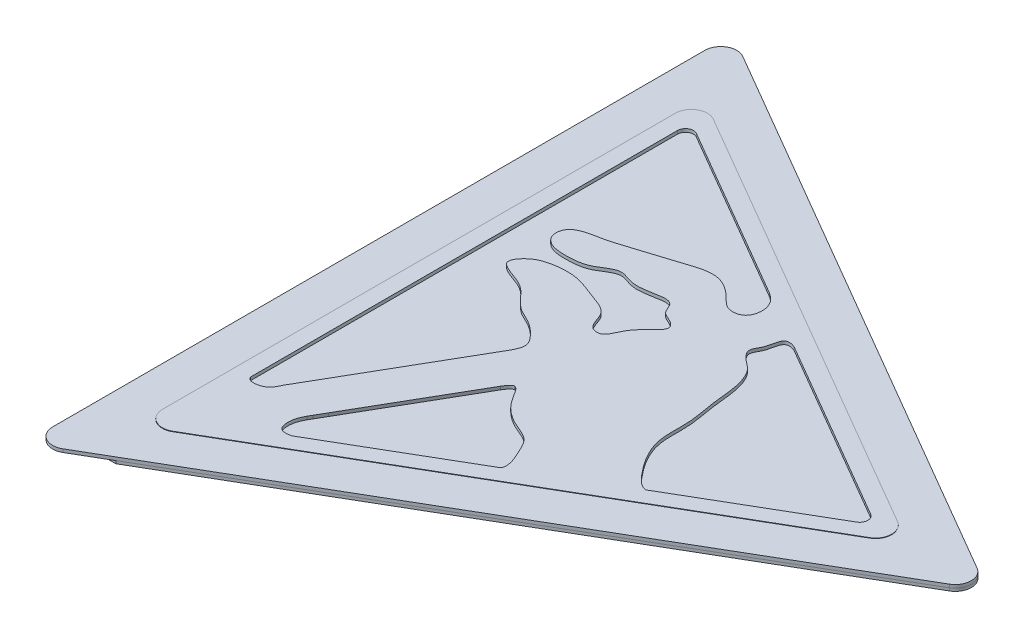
ISO-10303-21;
HEADER;
FILE_DESCRIPTION(('STEP AP214'),'2;1');
FILE_NAME('part.step','',(''),(''),'','','');
FILE_SCHEMA(('AUTOMOTIVE_DESIGN { 1 0 10303 214 1 1 1 1 }'));
ENDSEC;
DATA;
#1=APPLICATION_CONTEXT('core data for automotive mechanical design processes');
#2=APPLICATION_PROTOCOL_DEFINITION('international standard','automotive_design',2000,#1);
#3=PRODUCT_CONTEXT('',#1,'mechanical');
#4=PRODUCT('Part','Part','',(#3));
#5=PRODUCT_RELATED_PRODUCT_CATEGORY('part','',(#4));
#6=PRODUCT_DEFINITION_FORMATION('','',#4);
#7=PRODUCT_DEFINITION_CONTEXT('part definition',#1,'design');
#8=PRODUCT_DEFINITION('design','',#6,#7);
#9=PRODUCT_DEFINITION_SHAPE('','',#8);
#10=(LENGTH_UNIT() NAMED_UNIT(*) SI_UNIT(.MILLI.,.METRE.));
#11=(NAMED_UNIT(*) PLANE_ANGLE_UNIT() SI_UNIT($,.RADIAN.));
#12=(NAMED_UNIT(*) SI_UNIT($,.STERADIAN.) SOLID_ANGLE_UNIT());
#13=UNCERTAINTY_MEASURE_WITH_UNIT(LENGTH_MEASURE(1.E-05),#10,'distance_accuracy_value','');
#14=(GEOMETRIC_REPRESENTATION_CONTEXT(3) GLOBAL_UNCERTAINTY_ASSIGNED_CONTEXT((#13)) GLOBAL_UNIT_ASSIGNED_CONTEXT((#10,
#11,#12)) REPRESENTATION_CONTEXT('',''));
#15=CARTESIAN_POINT('',(0.,0.,0.));
#16=DIRECTION('',(0.,0.,1.));
#17=DIRECTION('',(1.,0.,0.));
#18=AXIS2_PLACEMENT_3D('',#15,#16,#17);
#19=CARTESIAN_POINT('',(10.3437184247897,0.205,0.));
#20=DIRECTION('',(0.,-1.,0.));
#21=DIRECTION('',(0.,0.,-1.));
#22=AXIS2_PLACEMENT_3D('',#19,#20,#21);
#23=PLANE('',#22);
#24=CARTESIAN_POINT('',(10.3437184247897,0.205,0.));
#25=DIRECTION('',(0.,1.,0.));
#26=DIRECTION('',(0.,0.,-1.));
#27=AXIS2_PLACEMENT_3D('',#24,#25,#26);
#28=CIRCLE('',#27,0.550000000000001);
#29=CARTESIAN_POINT('',(10.6203098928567,0.205,0.475391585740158));
#30=VERTEX_POINT('',#29);
#31=CARTESIAN_POINT('',(10.6203098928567,0.205,-0.475391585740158));
#32=VERTEX_POINT('',#31);
#33=EDGE_CURVE('E195',#30,#32,#28,.T.);
#34=ORIENTED_EDGE('',*,*,#33,.T.);
#35=DIRECTION('',(-0.864348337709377,0.,-0.502893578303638));
#36=VECTOR('',#35,1.);
#37=CARTESIAN_POINT('',(10.6203098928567,0.205,-0.475391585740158));
#38=LINE('',#37,#36);
#39=CARTESIAN_POINT('',(-8.61386699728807,0.205,-11.6661854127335));
#40=VERTEX_POINT('',#39);
#41=EDGE_CURVE('E198',#32,#40,#38,.T.);
#42=ORIENTED_EDGE('',*,*,#41,.T.);
#43=CARTESIAN_POINT('',(-8.89045846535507,0.205,-11.1907938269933));
#44=DIRECTION('',(0.,1.,0.));
#45=DIRECTION('',(0.,0.,-1.));
#46=AXIS2_PLACEMENT_3D('',#43,#44,#45);
#47=CIRCLE('',#46,0.55);
#48=CARTESIAN_POINT('',(-9.44045846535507,0.205,-11.1907938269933));
#49=VERTEX_POINT('',#48);
#50=EDGE_CURVE('E200',#40,#49,#47,.T.);
#51=ORIENTED_EDGE('',*,*,#50,.T.);
#52=DIRECTION('',(0.,0.,1.));
#53=VECTOR('',#52,1.);
#54=CARTESIAN_POINT('',(-9.44045846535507,0.205,-11.1907938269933));
#55=LINE('',#54,#53);
#56=CARTESIAN_POINT('',(-9.44045846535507,0.205,11.1907938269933));
#57=VERTEX_POINT('',#56);
#58=EDGE_CURVE('E202',#49,#57,#55,.T.);
#59=ORIENTED_EDGE('',*,*,#58,.T.);
#60=CARTESIAN_POINT('',(-8.89045846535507,0.205,11.1907938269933));
#61=DIRECTION('',(0.,1.,0.));
#62=DIRECTION('',(0.,0.,1.));
#63=AXIS2_PLACEMENT_3D('',#60,#61,#62);
#64=CIRCLE('',#63,0.549999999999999);
#65=CARTESIAN_POINT('',(-8.61386699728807,0.205,11.6661854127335));
#66=VERTEX_POINT('',#65);
#67=EDGE_CURVE('E204',#57,#66,#64,.T.);
#68=ORIENTED_EDGE('',*,*,#67,.T.);
#69=DIRECTION('',(0.864348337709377,0.,-0.502893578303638));
#70=VECTOR('',#69,1.);
#71=CARTESIAN_POINT('',(-8.61386699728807,0.205,11.6661854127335));
#72=LINE('',#71,#70);
#73=EDGE_CURVE('E206',#66,#30,#72,.T.);
#74=ORIENTED_EDGE('',*,*,#73,.T.);
#75=EDGE_LOOP('',(#34,#42,#51,#59,#68,#74));
#76=FACE_BOUND('',#75,.T.);
#77=CARTESIAN_POINT('',(-7.51545846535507,0.205,-8.8));
#78=DIRECTION('',(0.,1.,0.));
#79=DIRECTION('',(0.,0.,1.));
#80=AXIS2_PLACEMENT_3D('',#77,#78,#79);
#81=CIRCLE('',#80,0.550000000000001);
#82=CARTESIAN_POINT('',(-7.23886699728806,0.205,-9.27539158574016));
#83=VERTEX_POINT('',#82);
#84=CARTESIAN_POINT('',(-8.06545846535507,0.205,-8.8));
#85=VERTEX_POINT('',#84);
#86=EDGE_CURVE('E148',#83,#85,#81,.T.);
#87=ORIENTED_EDGE('',*,*,#86,.F.);
#88=DIRECTION('',(-0.864348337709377,0.,-0.502893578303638));
#89=VECTOR('',#88,1.);
#90=CARTESIAN_POINT('',(7.88613300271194,0.205,-0.475391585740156));
#91=LINE('',#90,#89);
#92=CARTESIAN_POINT('',(7.88613300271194,0.205,-0.475391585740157));
#93=VERTEX_POINT('',#92);
#94=EDGE_CURVE('E173',#93,#83,#91,.T.);
#95=ORIENTED_EDGE('',*,*,#94,.F.);
#96=CARTESIAN_POINT('',(7.60954153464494,0.205,0.));
#97=DIRECTION('',(0.,1.,0.));
#98=DIRECTION('',(0.,0.,1.));
#99=AXIS2_PLACEMENT_3D('',#96,#97,#98);
#100=CIRCLE('',#99,0.549999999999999);
#101=CARTESIAN_POINT('',(7.88613300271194,0.205,0.475391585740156));
#102=VERTEX_POINT('',#101);
#103=EDGE_CURVE('E171',#102,#93,#100,.T.);
#104=ORIENTED_EDGE('',*,*,#103,.F.);
#105=DIRECTION('',(0.864348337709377,0.,-0.502893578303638));
#106=VECTOR('',#105,1.);
#107=CARTESIAN_POINT('',(-7.23886699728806,0.205,9.27539158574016));
#108=LINE('',#107,#106);
#109=CARTESIAN_POINT('',(-7.23886699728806,0.205,9.27539158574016));
#110=VERTEX_POINT('',#109);
#111=EDGE_CURVE('E169',#110,#102,#108,.T.);
#112=ORIENTED_EDGE('',*,*,#111,.F.);
#113=CARTESIAN_POINT('',(-7.51545846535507,0.205,8.8));
#114=DIRECTION('',(0.,1.,0.));
#115=DIRECTION('',(0.,0.,1.));
#116=AXIS2_PLACEMENT_3D('',#113,#114,#115);
#117=CIRCLE('',#116,0.550000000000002);
#118=CARTESIAN_POINT('',(-8.06545846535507,0.205,8.8));
#119=VERTEX_POINT('',#118);
#120=EDGE_CURVE('E167',#119,#110,#117,.T.);
#121=ORIENTED_EDGE('',*,*,#120,.F.);
#122=DIRECTION('',(0.,0.,1.));
#123=VECTOR('',#122,1.);
#124=CARTESIAN_POINT('',(-8.06545846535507,0.205,-8.8));
#125=LINE('',#124,#123);
#126=EDGE_CURVE('E165',#85,#119,#125,.T.);
#127=ORIENTED_EDGE('',*,*,#126,.F.);
#128=EDGE_LOOP('',(#87,#95,#104,#112,#121,#127));
#129=FACE_BOUND('',#128,.T.);
#130=ADVANCED_FACE('F44',(#76,#129),#23,.F.);
#131=CARTESIAN_POINT('',(10.3437184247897,0.095,0.));
#132=DIRECTION('',(0.,-1.,0.));
#133=DIRECTION('',(0.,0.,-1.));
#134=AXIS2_PLACEMENT_3D('',#131,#132,#133);
#135=PLANE('',#134);
#136=CARTESIAN_POINT('',(10.3437184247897,0.095,0.));
#137=DIRECTION('',(0.,1.,0.));
#138=DIRECTION('',(0.,0.,-1.));
#139=AXIS2_PLACEMENT_3D('',#136,#137,#138);
#140=CIRCLE('',#139,0.550000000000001);
#141=CARTESIAN_POINT('',(10.6203098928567,0.095,0.475391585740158));
#142=VERTEX_POINT('',#141);
#143=CARTESIAN_POINT('',(10.6203098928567,0.095,-0.475391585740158));
#144=VERTEX_POINT('',#143);
#145=EDGE_CURVE('E149',#142,#144,#140,.T.);
#146=ORIENTED_EDGE('',*,*,#145,.F.);
#147=DIRECTION('',(0.864348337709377,0.,-0.502893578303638));
#148=VECTOR('',#147,1.);
#149=CARTESIAN_POINT('',(-8.61386699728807,0.095,11.6661854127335));
#150=LINE('',#149,#148);
#151=CARTESIAN_POINT('',(-8.61386699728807,0.095,11.6661854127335));
#152=VERTEX_POINT('',#151);
#153=EDGE_CURVE('E193',#152,#142,#150,.T.);
#154=ORIENTED_EDGE('',*,*,#153,.F.);
#155=CARTESIAN_POINT('',(-8.89045846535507,0.095,11.1907938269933));
#156=DIRECTION('',(0.,1.,0.));
#157=DIRECTION('',(0.,0.,1.));
#158=AXIS2_PLACEMENT_3D('',#155,#156,#157);
#159=CIRCLE('',#158,0.549999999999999);
#160=CARTESIAN_POINT('',(-9.44045846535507,0.095,11.1907938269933));
#161=VERTEX_POINT('',#160);
#162=EDGE_CURVE('E191',#161,#152,#159,.T.);
#163=ORIENTED_EDGE('',*,*,#162,.F.);
#164=DIRECTION('',(0.,0.,1.));
#165=VECTOR('',#164,1.);
#166=CARTESIAN_POINT('',(-9.44045846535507,0.095,-11.1907938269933));
#167=LINE('',#166,#165);
#168=CARTESIAN_POINT('',(-9.44045846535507,0.095,-11.1907938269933));
#169=VERTEX_POINT('',#168);
#170=EDGE_CURVE('E189',#169,#161,#167,.T.);
#171=ORIENTED_EDGE('',*,*,#170,.F.);
#172=CARTESIAN_POINT('',(-8.89045846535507,0.095,-11.1907938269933));
#173=DIRECTION('',(0.,1.,0.));
#174=DIRECTION('',(0.,0.,-1.));
#175=AXIS2_PLACEMENT_3D('',#172,#173,#174);
#176=CIRCLE('',#175,0.55);
#177=CARTESIAN_POINT('',(-8.61386699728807,0.095,-11.6661854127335));
#178=VERTEX_POINT('',#177);
#179=EDGE_CURVE('E187',#178,#169,#176,.T.);
#180=ORIENTED_EDGE('',*,*,#179,.F.);
#181=DIRECTION('',(-0.864348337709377,0.,-0.502893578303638));
#182=VECTOR('',#181,1.);
#183=CARTESIAN_POINT('',(10.6203098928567,0.095,-0.475391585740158));
#184=LINE('',#183,#182);
#185=EDGE_CURVE('E185',#144,#178,#184,.T.);
#186=ORIENTED_EDGE('',*,*,#185,.F.);
#187=EDGE_LOOP('',(#146,#154,#163,#171,#180,#186));
#188=FACE_BOUND('',#187,.T.);
#189=DIRECTION('',(-0.864348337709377,0.,-0.502893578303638));
#190=VECTOR('',#189,1.);
#191=CARTESIAN_POINT('',(7.88613300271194,0.095,-0.475391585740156));
#192=LINE('',#191,#190);
#193=CARTESIAN_POINT('',(7.88613300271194,0.095,-0.475391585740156));
#194=VERTEX_POINT('',#193);
#195=CARTESIAN_POINT('',(-7.23886699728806,0.095,-9.27539158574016));
#196=VERTEX_POINT('',#195);
#197=EDGE_CURVE('E154',#194,#196,#192,.T.);
#198=ORIENTED_EDGE('',*,*,#197,.T.);
#199=CARTESIAN_POINT('',(-7.51545846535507,0.095,-8.8));
#200=DIRECTION('',(0.,1.,0.));
#201=DIRECTION('',(0.,0.,1.));
#202=AXIS2_PLACEMENT_3D('',#199,#200,#201);
#203=CIRCLE('',#202,0.550000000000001);
#204=CARTESIAN_POINT('',(-8.06545846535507,0.095,-8.8));
#205=VERTEX_POINT('',#204);
#206=EDGE_CURVE('E67',#196,#205,#203,.T.);
#207=ORIENTED_EDGE('',*,*,#206,.T.);
#208=DIRECTION('',(0.,0.,1.));
#209=VECTOR('',#208,1.);
#210=CARTESIAN_POINT('',(-8.06545846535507,0.095,-8.8));
#211=LINE('',#210,#209);
#212=CARTESIAN_POINT('',(-8.06545846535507,0.095,8.8));
#213=VERTEX_POINT('',#212);
#214=EDGE_CURVE('E135',#205,#213,#211,.T.);
#215=ORIENTED_EDGE('',*,*,#214,.T.);
#216=CARTESIAN_POINT('',(-7.51545846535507,0.095,8.8));
#217=DIRECTION('',(0.,1.,0.));
#218=DIRECTION('',(0.,0.,1.));
#219=AXIS2_PLACEMENT_3D('',#216,#217,#218);
#220=CIRCLE('',#219,0.550000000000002);
#221=CARTESIAN_POINT('',(-7.23886699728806,0.095,9.27539158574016));
#222=VERTEX_POINT('',#221);
#223=EDGE_CURVE('E144',#213,#222,#220,.T.);
#224=ORIENTED_EDGE('',*,*,#223,.T.);
#225=DIRECTION('',(0.864348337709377,0.,-0.502893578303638));
#226=VECTOR('',#225,1.);
#227=CARTESIAN_POINT('',(-7.23886699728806,0.095,9.27539158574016));
#228=LINE('',#227,#226);
#229=CARTESIAN_POINT('',(7.88613300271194,0.095,0.475391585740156));
#230=VERTEX_POINT('',#229);
#231=EDGE_CURVE('E158',#222,#230,#228,.T.);
#232=ORIENTED_EDGE('',*,*,#231,.T.);
#233=CARTESIAN_POINT('',(7.60954153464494,0.095,0.));
#234=DIRECTION('',(0.,1.,0.));
#235=DIRECTION('',(0.,0.,1.));
#236=AXIS2_PLACEMENT_3D('',#233,#234,#235);
#237=CIRCLE('',#236,0.549999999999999);
#238=EDGE_CURVE('E161',#230,#194,#237,.T.);
#239=ORIENTED_EDGE('',*,*,#238,.T.);
#240=EDGE_LOOP('',(#198,#207,#215,#224,#232,#239));
#241=FACE_BOUND('',#240,.T.);
#242=ADVANCED_FACE('F152',(#188,#241),#135,.T.);
#243=CARTESIAN_POINT('',(10.3437184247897,0.205,0.));
#244=DIRECTION('',(0.,-1.,0.));
#245=DIRECTION('',(0.,0.,-1.));
#246=AXIS2_PLACEMENT_3D('',#243,#244,#245);
#247=CYLINDRICAL_SURFACE('',#246,0.550000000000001);
#248=ORIENTED_EDGE('',*,*,#145,.T.);
#249=DIRECTION('',(0.,-1.,0.));
#250=VECTOR('',#249,1.);
#251=CARTESIAN_POINT('',(10.6203098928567,0.205,-0.475391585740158));
#252=LINE('',#251,#250);
#253=EDGE_CURVE('E13',#32,#144,#252,.T.);
#254=ORIENTED_EDGE('',*,*,#253,.F.);
#255=ORIENTED_EDGE('',*,*,#33,.F.);
#256=DIRECTION('',(0.,-1.,0.));
#257=VECTOR('',#256,1.);
#258=CARTESIAN_POINT('',(10.6203098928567,0.205,0.475391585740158));
#259=LINE('',#258,#257);
#260=EDGE_CURVE('E208',#30,#142,#259,.T.);
#261=ORIENTED_EDGE('',*,*,#260,.T.);
#262=EDGE_LOOP('',(#248,#254,#255,#261));
#263=FACE_BOUND('',#262,.T.);
#264=ADVANCED_FACE('F46',(#263),#247,.T.);
#265=CARTESIAN_POINT('',(10.6203098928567,0.205,-0.475391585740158));
#266=DIRECTION('',(-0.502893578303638,0.,0.864348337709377));
#267=DIRECTION('',(0.864348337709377,0.,0.502893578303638));
#268=AXIS2_PLACEMENT_3D('',#265,#266,#267);
#269=PLANE('',#268);
#270=ORIENTED_EDGE('',*,*,#185,.T.);
#271=DIRECTION('',(0.,-1.,0.));
#272=VECTOR('',#271,1.);
#273=CARTESIAN_POINT('',(-8.61386699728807,0.205,-11.6661854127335));
#274=LINE('',#273,#272);
#275=EDGE_CURVE('E52',#40,#178,#274,.T.);
#276=ORIENTED_EDGE('',*,*,#275,.F.);
#277=ORIENTED_EDGE('',*,*,#41,.F.);
#278=ORIENTED_EDGE('',*,*,#253,.T.);
#279=EDGE_LOOP('',(#270,#276,#277,#278));
#280=FACE_BOUND('',#279,.T.);
#281=ADVANCED_FACE('F246',(#280),#269,.F.);
#282=CARTESIAN_POINT('',(-8.89045846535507,0.205,-11.1907938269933));
#283=DIRECTION('',(0.,-1.,0.));
#284=DIRECTION('',(0.,0.,-1.));
#285=AXIS2_PLACEMENT_3D('',#282,#283,#284);
#286=CYLINDRICAL_SURFACE('',#285,0.55);
#287=ORIENTED_EDGE('',*,*,#179,.T.);
#288=DIRECTION('',(0.,-1.,0.));
#289=VECTOR('',#288,1.);
#290=CARTESIAN_POINT('',(-9.44045846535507,0.205,-11.1907938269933));
#291=LINE('',#290,#289);
#292=EDGE_CURVE('E217',#49,#169,#291,.T.);
#293=ORIENTED_EDGE('',*,*,#292,.F.);
#294=ORIENTED_EDGE('',*,*,#50,.F.);
#295=ORIENTED_EDGE('',*,*,#275,.T.);
#296=EDGE_LOOP('',(#287,#293,#294,#295));
#297=FACE_BOUND('',#296,.T.);
#298=ADVANCED_FACE('F224',(#297),#286,.T.);
#299=CARTESIAN_POINT('',(-9.44045846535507,0.205,-11.1907938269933));
#300=DIRECTION('',(1.,0.,0.));
#301=DIRECTION('',(0.,0.,-1.));
#302=AXIS2_PLACEMENT_3D('',#299,#300,#301);
#303=PLANE('',#302);
#304=ORIENTED_EDGE('',*,*,#170,.T.);
#305=DIRECTION('',(0.,-1.,0.));
#306=VECTOR('',#305,1.);
#307=CARTESIAN_POINT('',(-9.44045846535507,0.205,11.1907938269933));
#308=LINE('',#307,#306);
#309=EDGE_CURVE('E214',#57,#161,#308,.T.);
#310=ORIENTED_EDGE('',*,*,#309,.F.);
#311=ORIENTED_EDGE('',*,*,#58,.F.);
#312=ORIENTED_EDGE('',*,*,#292,.T.);
#313=EDGE_LOOP('',(#304,#310,#311,#312));
#314=FACE_BOUND('',#313,.T.);
#315=ADVANCED_FACE('F234',(#314),#303,.F.);
#316=CARTESIAN_POINT('',(-8.89045846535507,0.205,11.1907938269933));
#317=DIRECTION('',(0.,-1.,0.));
#318=DIRECTION('',(0.,0.,-1.));
#319=AXIS2_PLACEMENT_3D('',#316,#317,#318);
#320=CYLINDRICAL_SURFACE('',#319,0.549999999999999);
#321=ORIENTED_EDGE('',*,*,#162,.T.);
#322=DIRECTION('',(0.,-1.,0.));
#323=VECTOR('',#322,1.);
#324=CARTESIAN_POINT('',(-8.61386699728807,0.205,11.6661854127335));
#325=LINE('',#324,#323);
#326=EDGE_CURVE('E211',#66,#152,#325,.T.);
#327=ORIENTED_EDGE('',*,*,#326,.F.);
#328=ORIENTED_EDGE('',*,*,#67,.F.);
#329=ORIENTED_EDGE('',*,*,#309,.T.);
#330=EDGE_LOOP('',(#321,#327,#328,#329));
#331=FACE_BOUND('',#330,.T.);
#332=ADVANCED_FACE('F238',(#331),#320,.T.);
#333=CARTESIAN_POINT('',(-8.61386699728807,0.205,11.6661854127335));
#334=DIRECTION('',(-0.502893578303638,0.,-0.864348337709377));
#335=DIRECTION('',(-0.864348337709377,0.,0.502893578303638));
#336=AXIS2_PLACEMENT_3D('',#333,#334,#335);
#337=PLANE('',#336);
#338=ORIENTED_EDGE('',*,*,#153,.T.);
#339=ORIENTED_EDGE('',*,*,#260,.F.);
#340=ORIENTED_EDGE('',*,*,#73,.F.);
#341=ORIENTED_EDGE('',*,*,#326,.T.);
#342=EDGE_LOOP('',(#338,#339,#340,#341));
#343=FACE_BOUND('',#342,.T.);
#344=ADVANCED_FACE('F249',(#343),#337,.F.);
#345=CARTESIAN_POINT('',(-7.51545846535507,0.205,-8.8));
#346=DIRECTION('',(0.,-1.,0.));
#347=DIRECTION('',(0.,0.,-1.));
#348=AXIS2_PLACEMENT_3D('',#345,#346,#347);
#349=CYLINDRICAL_SURFACE('',#348,0.550000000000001);
#350=ORIENTED_EDGE('',*,*,#206,.F.);
#351=DIRECTION('',(0.,-1.,0.));
#352=VECTOR('',#351,1.);
#353=CARTESIAN_POINT('',(-7.23886699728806,0.205,-9.27539158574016));
#354=LINE('',#353,#352);
#355=EDGE_CURVE('E175',#83,#196,#354,.T.);
#356=ORIENTED_EDGE('',*,*,#355,.F.);
#357=ORIENTED_EDGE('',*,*,#86,.T.);
#358=DIRECTION('',(0.,-1.,0.));
#359=VECTOR('',#358,1.);
#360=CARTESIAN_POINT('',(-8.06545846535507,0.205,-8.8));
#361=LINE('',#360,#359);
#362=EDGE_CURVE('E137',#85,#205,#361,.T.);
#363=ORIENTED_EDGE('',*,*,#362,.T.);
#364=EDGE_LOOP('',(#350,#356,#357,#363));
#365=FACE_BOUND('',#364,.T.);
#366=ADVANCED_FACE('F146',(#365),#349,.F.);
#367=CARTESIAN_POINT('',(-8.06545846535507,0.205,-8.8));
#368=DIRECTION('',(1.,0.,0.));
#369=DIRECTION('',(0.,0.,-1.));
#370=AXIS2_PLACEMENT_3D('',#367,#368,#369);
#371=PLANE('',#370);
#372=ORIENTED_EDGE('',*,*,#214,.F.);
#373=ORIENTED_EDGE('',*,*,#362,.F.);
#374=ORIENTED_EDGE('',*,*,#126,.T.);
#375=DIRECTION('',(0.,-1.,0.));
#376=VECTOR('',#375,1.);
#377=CARTESIAN_POINT('',(-8.06545846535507,0.205,8.8));
#378=LINE('',#377,#376);
#379=EDGE_CURVE('E140',#119,#213,#378,.T.);
#380=ORIENTED_EDGE('',*,*,#379,.T.);
#381=EDGE_LOOP('',(#372,#373,#374,#380));
#382=FACE_BOUND('',#381,.T.);
#383=ADVANCED_FACE('F136',(#382),#371,.T.);
#384=CARTESIAN_POINT('',(-7.51545846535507,0.205,8.8));
#385=DIRECTION('',(0.,-1.,0.));
#386=DIRECTION('',(0.,0.,-1.));
#387=AXIS2_PLACEMENT_3D('',#384,#385,#386);
#388=CYLINDRICAL_SURFACE('',#387,0.550000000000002);
#389=ORIENTED_EDGE('',*,*,#223,.F.);
#390=ORIENTED_EDGE('',*,*,#379,.F.);
#391=ORIENTED_EDGE('',*,*,#120,.T.);
#392=DIRECTION('',(0.,-1.,0.));
#393=VECTOR('',#392,1.);
#394=CARTESIAN_POINT('',(-7.23886699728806,0.205,9.27539158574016));
#395=LINE('',#394,#393);
#396=EDGE_CURVE('E180',#110,#222,#395,.T.);
#397=ORIENTED_EDGE('',*,*,#396,.T.);
#398=EDGE_LOOP('',(#389,#390,#391,#397));
#399=FACE_BOUND('',#398,.T.);
#400=ADVANCED_FACE('F267',(#399),#388,.F.);
#401=CARTESIAN_POINT('',(-7.23886699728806,0.205,9.27539158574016));
#402=DIRECTION('',(-0.502893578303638,0.,-0.864348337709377));
#403=DIRECTION('',(-0.864348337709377,0.,0.502893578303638));
#404=AXIS2_PLACEMENT_3D('',#401,#402,#403);
#405=PLANE('',#404);
#406=ORIENTED_EDGE('',*,*,#231,.F.);
#407=ORIENTED_EDGE('',*,*,#396,.F.);
#408=ORIENTED_EDGE('',*,*,#111,.T.);
#409=DIRECTION('',(0.,-1.,0.));
#410=VECTOR('',#409,1.);
#411=CARTESIAN_POINT('',(7.88613300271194,0.205,0.475391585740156));
#412=LINE('',#411,#410);
#413=EDGE_CURVE('E178',#102,#230,#412,.T.);
#414=ORIENTED_EDGE('',*,*,#413,.T.);
#415=EDGE_LOOP('',(#406,#407,#408,#414));
#416=FACE_BOUND('',#415,.T.);
#417=ADVANCED_FACE('F270',(#416),#405,.T.);
#418=CARTESIAN_POINT('',(7.60954153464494,0.205,0.));
#419=DIRECTION('',(0.,-1.,0.));
#420=DIRECTION('',(0.,0.,-1.));
#421=AXIS2_PLACEMENT_3D('',#418,#419,#420);
#422=CYLINDRICAL_SURFACE('',#421,0.549999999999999);
#423=ORIENTED_EDGE('',*,*,#238,.F.);
#424=ORIENTED_EDGE('',*,*,#413,.F.);
#425=ORIENTED_EDGE('',*,*,#103,.T.);
#426=DIRECTION('',(0.,-1.,0.));
#427=VECTOR('',#426,1.);
#428=CARTESIAN_POINT('',(7.88613300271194,0.205,-0.475391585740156));
#429=LINE('',#428,#427);
#430=EDGE_CURVE('E59',#93,#194,#429,.T.);
#431=ORIENTED_EDGE('',*,*,#430,.T.);
#432=EDGE_LOOP('',(#423,#424,#425,#431));
#433=FACE_BOUND('',#432,.T.);
#434=ADVANCED_FACE('F274',(#433),#422,.F.);
#435=CARTESIAN_POINT('',(7.88613300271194,0.205,-0.475391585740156));
#436=DIRECTION('',(-0.502893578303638,0.,0.864348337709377));
#437=DIRECTION('',(0.864348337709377,0.,0.502893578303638));
#438=AXIS2_PLACEMENT_3D('',#435,#436,#437);
#439=PLANE('',#438);
#440=ORIENTED_EDGE('',*,*,#197,.F.);
#441=ORIENTED_EDGE('',*,*,#430,.F.);
#442=ORIENTED_EDGE('',*,*,#94,.T.);
#443=ORIENTED_EDGE('',*,*,#355,.T.);
#444=EDGE_LOOP('',(#440,#441,#442,#443));
#445=FACE_BOUND('',#444,.T.);
#446=ADVANCED_FACE('F278',(#445),#439,.T.);
#447=CLOSED_SHELL('',(#130,#242,#264,#281,#298,#315,#332,#344,#366,#383,#400,#417,#434,#446));
#448=MANIFOLD_SOLID_BREP('B2',#447);
#449=CARTESIAN_POINT('',(-10.7560214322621,0.102499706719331,10.9896499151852));
#450=DIRECTION('',(0.,1.,0.));
#451=DIRECTION('',(0.,0.,1.));
#452=AXIS2_PLACEMENT_3D('',#449,#450,#451);
#453=PLANE('',#452);
#454=DIRECTION('',(-0.864348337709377,0.,-0.502893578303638));
#455=VECTOR('',#454,1.);
#456=CARTESIAN_POINT('',(-7.24394728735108,0.102499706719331,-9.28574167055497));
#457=LINE('',#456,#455);
#458=CARTESIAN_POINT('',(7.88105271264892,0.102499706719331,-0.485741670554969));
#459=VERTEX_POINT('',#458);
#460=CARTESIAN_POINT('',(-7.24394728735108,0.102499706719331,-9.28574167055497));
#461=VERTEX_POINT('',#460);
#462=EDGE_CURVE('E809',#459,#461,#457,.T.);
#463=ORIENTED_EDGE('',*,*,#462,.F.);
#464=CARTESIAN_POINT('',(7.60446124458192,0.102499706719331,-0.0103500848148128));
#465=DIRECTION('',(0.,1.,0.));
#466=DIRECTION('',(0.,0.,1.));
#467=AXIS2_PLACEMENT_3D('',#464,#465,#466);
#468=CIRCLE('',#467,0.549999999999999);
#469=CARTESIAN_POINT('',(7.88105271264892,0.102499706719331,0.465041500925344));
#470=VERTEX_POINT('',#469);
#471=EDGE_CURVE('E806',#470,#459,#468,.T.);
#472=ORIENTED_EDGE('',*,*,#471,.F.);
#473=DIRECTION('',(0.864348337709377,0.,-0.502893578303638));
#474=VECTOR('',#473,1.);
#475=CARTESIAN_POINT('',(7.88105271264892,0.102499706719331,0.465041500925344));
#476=LINE('',#475,#474);
#477=CARTESIAN_POINT('',(-7.24394728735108,0.102499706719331,9.26504150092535));
#478=VERTEX_POINT('',#477);
#479=EDGE_CURVE('E823',#478,#470,#476,.T.);
#480=ORIENTED_EDGE('',*,*,#479,.F.);
#481=CARTESIAN_POINT('',(-7.52053875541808,0.102499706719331,8.78964991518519));
#482=DIRECTION('',(0.,1.,0.));
#483=DIRECTION('',(0.,0.,-1.));
#484=AXIS2_PLACEMENT_3D('',#481,#482,#483);
#485=CIRCLE('',#484,0.550000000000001);
#486=CARTESIAN_POINT('',(-8.07053875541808,0.102499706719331,8.78964991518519));
#487=VERTEX_POINT('',#486);
#488=EDGE_CURVE('E820',#487,#478,#485,.T.);
#489=ORIENTED_EDGE('',*,*,#488,.F.);
#490=DIRECTION('',(0.,0.,1.));
#491=VECTOR('',#490,1.);
#492=CARTESIAN_POINT('',(-8.07053875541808,0.102499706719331,8.78964991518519));
#493=LINE('',#492,#491);
#494=CARTESIAN_POINT('',(-8.07053875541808,0.102499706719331,-8.81035008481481));
#495=VERTEX_POINT('',#494);
#496=EDGE_CURVE('E818',#495,#487,#493,.T.);
#497=ORIENTED_EDGE('',*,*,#496,.F.);
#498=CARTESIAN_POINT('',(-7.52053875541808,0.102499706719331,-8.81035008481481));
#499=DIRECTION('',(0.,1.,0.));
#500=DIRECTION('',(0.,0.,-1.));
#501=AXIS2_PLACEMENT_3D('',#498,#499,#500);
#502=CIRCLE('',#501,0.550000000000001);
#503=EDGE_CURVE('E816',#461,#495,#502,.T.);
#504=ORIENTED_EDGE('',*,*,#503,.F.);
#505=EDGE_LOOP('',(#463,#472,#480,#489,#497,#504));
#506=FACE_BOUND('',#505,.T.);
#507=DIRECTION('',(-1.,0.,0.));
#508=VECTOR('',#507,1.);
#509=CARTESIAN_POINT('',(-10.7560214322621,0.102499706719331,-11.0103500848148));
#510=LINE('',#509,#508);
#511=CARTESIAN_POINT('',(-7.47394110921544,0.102499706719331,-11.0103500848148));
#512=VERTEX_POINT('',#511);
#513=CARTESIAN_POINT('',(-9.44553875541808,0.102499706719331,-11.0103500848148));
#514=VERTEX_POINT('',#513);
#515=EDGE_CURVE('E572',#512,#514,#510,.T.);
#516=ORIENTED_EDGE('',*,*,#515,.T.);
#517=DIRECTION('',(0.,0.,1.));
#518=VECTOR('',#517,1.);
#519=CARTESIAN_POINT('',(-9.44553875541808,0.102499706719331,10.9896499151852));
#520=LINE('',#519,#518);
#521=CARTESIAN_POINT('',(-9.44553875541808,0.102499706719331,10.9896499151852));
#522=VERTEX_POINT('',#521);
#523=EDGE_CURVE('E592',#514,#522,#520,.T.);
#524=ORIENTED_EDGE('',*,*,#523,.T.);
#525=DIRECTION('',(1.,0.,0.));
#526=VECTOR('',#525,1.);
#527=CARTESIAN_POINT('',(-10.7560214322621,0.102499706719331,10.9896499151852));
#528=LINE('',#527,#526);
#529=CARTESIAN_POINT('',(-7.47394110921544,0.102499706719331,10.9896499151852));
#530=VERTEX_POINT('',#529);
#531=EDGE_CURVE('E859',#522,#530,#528,.T.);
#532=ORIENTED_EDGE('',*,*,#531,.T.);
#533=DIRECTION('',(0.864348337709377,0.,-0.502893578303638));
#534=VECTOR('',#533,1.);
#535=CARTESIAN_POINT('',(-9.92597691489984,0.102499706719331,12.4162889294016));
#536=LINE('',#535,#534);
#537=CARTESIAN_POINT('',(10.6152296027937,0.102499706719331,0.465041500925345));
#538=VERTEX_POINT('',#537);
#539=EDGE_CURVE('E598',#530,#538,#536,.T.);
#540=ORIENTED_EDGE('',*,*,#539,.T.);
#541=CARTESIAN_POINT('',(10.3386381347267,0.102499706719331,-0.0103500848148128));
#542=DIRECTION('',(0.,1.,0.));
#543=DIRECTION('',(0.,0.,1.));
#544=AXIS2_PLACEMENT_3D('',#541,#542,#543);
#545=CIRCLE('',#544,0.550000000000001);
#546=CARTESIAN_POINT('',(10.6152296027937,0.102499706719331,-0.485741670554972));
#547=VERTEX_POINT('',#546);
#548=EDGE_CURVE('E575',#538,#547,#545,.T.);
#549=ORIENTED_EDGE('',*,*,#548,.T.);
#550=DIRECTION('',(-0.864348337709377,0.,-0.502893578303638));
#551=VECTOR('',#550,1.);
#552=CARTESIAN_POINT('',(-0.363121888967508,0.102499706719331,-6.87314617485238));
#553=LINE('',#552,#551);
#554=EDGE_CURVE('E588',#547,#512,#553,.T.);
#555=ORIENTED_EDGE('',*,*,#554,.T.);
#556=EDGE_LOOP('',(#516,#524,#532,#540,#549,#555));
#557=FACE_BOUND('',#556,.T.);
#558=ADVANCED_FACE('F378',(#506,#557),#453,.T.);
#559=CARTESIAN_POINT('',(-10.7560214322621,0.102499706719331,10.9896499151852));
#560=DIRECTION('',(0.,0.,-1.));
#561=DIRECTION('',(-1.,0.,0.));
#562=AXIS2_PLACEMENT_3D('',#559,#560,#561);
#563=PLANE('',#562);
#564=DIRECTION('',(0.,-1.,0.));
#565=VECTOR('',#564,1.);
#566=CARTESIAN_POINT('',(-7.47394110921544,0.102499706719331,10.9896499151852));
#567=LINE('',#566,#565);
#568=CARTESIAN_POINT('',(-7.47394110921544,-0.00750029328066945,10.9896499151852));
#569=VERTEX_POINT('',#568);
#570=EDGE_CURVE('E568',#530,#569,#567,.T.);
#571=ORIENTED_EDGE('',*,*,#570,.F.);
#572=ORIENTED_EDGE('',*,*,#531,.F.);
#573=DIRECTION('',(0.,1.,0.));
#574=VECTOR('',#573,1.);
#575=CARTESIAN_POINT('',(-9.44553875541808,0.102499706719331,10.9896499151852));
#576=LINE('',#575,#574);
#577=CARTESIAN_POINT('',(-9.44553875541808,-0.00750029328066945,10.9896499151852));
#578=VERTEX_POINT('',#577);
#579=EDGE_CURVE('E595',#578,#522,#576,.T.);
#580=ORIENTED_EDGE('',*,*,#579,.F.);
#581=DIRECTION('',(1.,0.,0.));
#582=VECTOR('',#581,1.);
#583=CARTESIAN_POINT('',(-10.7560214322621,-0.00750029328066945,10.9896499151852));
#584=LINE('',#583,#582);
#585=EDGE_CURVE('E854',#578,#569,#584,.T.);
#586=ORIENTED_EDGE('',*,*,#585,.T.);
#587=EDGE_LOOP('',(#571,#572,#580,#586));
#588=FACE_BOUND('',#587,.T.);
#589=ADVANCED_FACE('F380',(#588),#563,.F.);
#590=CARTESIAN_POINT('',(-10.7560214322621,0.102499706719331,-11.0103500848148));
#591=DIRECTION('',(0.,0.,1.));
#592=DIRECTION('',(1.,0.,0.));
#593=AXIS2_PLACEMENT_3D('',#590,#591,#592);
#594=PLANE('',#593);
#595=DIRECTION('',(0.,-1.,0.));
#596=VECTOR('',#595,1.);
#597=CARTESIAN_POINT('',(-9.44553875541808,0.102499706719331,-11.0103500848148));
#598=LINE('',#597,#596);
#599=CARTESIAN_POINT('',(-9.44553875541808,-0.00750029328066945,-11.0103500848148));
#600=VERTEX_POINT('',#599);
#601=EDGE_CURVE('E400',#514,#600,#598,.T.);
#602=ORIENTED_EDGE('',*,*,#601,.F.);
#603=ORIENTED_EDGE('',*,*,#515,.F.);
#604=DIRECTION('',(0.,1.,0.));
#605=VECTOR('',#604,1.);
#606=CARTESIAN_POINT('',(-7.47394110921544,0.102499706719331,-11.0103500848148));
#607=LINE('',#606,#605);
#608=CARTESIAN_POINT('',(-7.47394110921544,-0.00750029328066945,-11.0103500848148));
#609=VERTEX_POINT('',#608);
#610=EDGE_CURVE('E576',#609,#512,#607,.T.);
#611=ORIENTED_EDGE('',*,*,#610,.F.);
#612=DIRECTION('',(-1.,0.,0.));
#613=VECTOR('',#612,1.);
#614=CARTESIAN_POINT('',(-10.7560214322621,-0.00750029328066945,-11.0103500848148));
#615=LINE('',#614,#613);
#616=EDGE_CURVE('E856',#609,#600,#615,.T.);
#617=ORIENTED_EDGE('',*,*,#616,.T.);
#618=EDGE_LOOP('',(#602,#603,#611,#617));
#619=FACE_BOUND('',#618,.T.);
#620=ADVANCED_FACE('F762',(#619),#594,.F.);
#621=CARTESIAN_POINT('',(-10.7560214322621,-0.00750029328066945,10.9896499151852));
#622=DIRECTION('',(0.,1.,0.));
#623=DIRECTION('',(0.,0.,1.));
#624=AXIS2_PLACEMENT_3D('',#621,#622,#623);
#625=PLANE('',#624);
#626=DIRECTION('',(0.,0.,1.));
#627=VECTOR('',#626,1.);
#628=CARTESIAN_POINT('',(-9.44553875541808,-0.00750029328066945,10.9896499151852));
#629=LINE('',#628,#627);
#630=EDGE_CURVE('E42',#600,#578,#629,.T.);
#631=ORIENTED_EDGE('',*,*,#630,.F.);
#632=ORIENTED_EDGE('',*,*,#616,.F.);
#633=DIRECTION('',(-0.864348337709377,0.,-0.502893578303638));
#634=VECTOR('',#633,1.);
#635=CARTESIAN_POINT('',(10.6152296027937,-0.00750029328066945,-0.485741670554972));
#636=LINE('',#635,#634);
#637=CARTESIAN_POINT('',(10.6152296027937,-0.00750029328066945,-0.485741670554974));
#638=VERTEX_POINT('',#637);
#639=EDGE_CURVE('E582',#638,#609,#636,.T.);
#640=ORIENTED_EDGE('',*,*,#639,.F.);
#641=CARTESIAN_POINT('',(10.3386381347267,-0.00750029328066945,-0.0103500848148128));
#642=DIRECTION('',(0.,1.,0.));
#643=DIRECTION('',(0.,0.,1.));
#644=AXIS2_PLACEMENT_3D('',#641,#642,#643);
#645=CIRCLE('',#644,0.550000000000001);
#646=CARTESIAN_POINT('',(10.6152296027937,-0.00750029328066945,0.465041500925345));
#647=VERTEX_POINT('',#646);
#648=EDGE_CURVE('E393',#647,#638,#645,.T.);
#649=ORIENTED_EDGE('',*,*,#648,.F.);
#650=DIRECTION('',(0.864348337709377,0.,-0.502893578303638));
#651=VECTOR('',#650,1.);
#652=CARTESIAN_POINT('',(-9.92597691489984,-0.00750029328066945,12.4162889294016));
#653=LINE('',#652,#651);
#654=EDGE_CURVE('E386',#569,#647,#653,.T.);
#655=ORIENTED_EDGE('',*,*,#654,.F.);
#656=ORIENTED_EDGE('',*,*,#585,.F.);
#657=EDGE_LOOP('',(#631,#632,#640,#649,#655,#656));
#658=FACE_BOUND('',#657,.T.);
#659=ADVANCED_FACE('F580',(#658),#625,.F.);
#660=CARTESIAN_POINT('',(7.60446124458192,0.212499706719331,-0.0103500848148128));
#661=DIRECTION('',(0.,1.,0.));
#662=DIRECTION('',(0.,0.,1.));
#663=AXIS2_PLACEMENT_3D('',#660,#661,#662);
#664=PLANE('',#663);
#665=DIRECTION('',(0.499742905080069,0.,-0.866173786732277));
#666=VECTOR('',#665,1.);
#667=CARTESIAN_POINT('',(-3.8429610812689,0.212499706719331,1.02580857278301));
#668=LINE('',#667,#666);
#669=CARTESIAN_POINT('',(-6.62974056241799,0.212499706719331,5.8559628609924));
#670=VERTEX_POINT('',#669);
#671=CARTESIAN_POINT('',(-3.8429610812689,0.212499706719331,1.02580857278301));
#672=VERTEX_POINT('',#671);
#673=EDGE_CURVE('E658',#670,#672,#668,.T.);
#674=ORIENTED_EDGE('',*,*,#673,.F.);
#675=CARTESIAN_POINT('',(-7.52053875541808,0.212499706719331,6.31119372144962));
#676=CARTESIAN_POINT('',(-7.47956526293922,0.212499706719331,6.49343994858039));
#677=CARTESIAN_POINT('',(-6.79604375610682,0.212499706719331,6.43126855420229));
#678=CARTESIAN_POINT('',(-6.74913410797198,0.212499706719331,6.02016176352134));
#679=CARTESIAN_POINT('',(-6.62974056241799,0.212499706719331,5.8559628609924));
#680=B_SPLINE_CURVE_WITH_KNOTS('',3,(#675,#676,#677,#678,#679),.UNSPECIFIED.,.F.,.F.,(4,1,4),
(0.12290254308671,0.133522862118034,0.145346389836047),.UNSPECIFIED.);
#681=CARTESIAN_POINT('',(-7.52053875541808,0.212499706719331,6.31119372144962));
#682=VERTEX_POINT('',#681);
#683=EDGE_CURVE('E927',#682,#670,#680,.T.);
#684=ORIENTED_EDGE('',*,*,#683,.F.);
#685=DIRECTION('',(0.,0.,1.));
#686=VECTOR('',#685,1.);
#687=CARTESIAN_POINT('',(-7.52053875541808,0.212499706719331,6.31119372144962));
#688=LINE('',#687,#686);
#689=CARTESIAN_POINT('',(-7.52053875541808,0.212499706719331,-8.33219131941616));
#690=VERTEX_POINT('',#689);
#691=EDGE_CURVE('E667',#690,#682,#688,.T.);
#692=ORIENTED_EDGE('',*,*,#691,.F.);
#693=CARTESIAN_POINT('',(-7.24553875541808,0.212499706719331,-8.33219131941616));
#694=DIRECTION('',(0.,1.,0.));
#695=DIRECTION('',(0.,0.,1.));
#696=AXIS2_PLACEMENT_3D('',#693,#694,#695);
#697=CIRCLE('',#696,0.274999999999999);
#698=CARTESIAN_POINT('',(-7.10724302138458,0.212499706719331,-8.56988711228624));
#699=VERTEX_POINT('',#698);
#700=EDGE_CURVE('E664',#699,#690,#697,.T.);
#701=ORIENTED_EDGE('',*,*,#700,.F.);
#702=DIRECTION('',(-0.864348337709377,0.,-0.502893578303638));
#703=VECTOR('',#702,1.);
#704=CARTESIAN_POINT('',(-7.10724302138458,0.212499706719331,-8.56988711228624));
#705=LINE('',#704,#703);
#706=CARTESIAN_POINT('',(-1.10554369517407,0.212499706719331,-5.07798932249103));
#707=VERTEX_POINT('',#706);
#708=EDGE_CURVE('E657',#707,#699,#705,.T.);
#709=ORIENTED_EDGE('',*,*,#708,.F.);
#710=CARTESIAN_POINT('',(-3.8429610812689,0.212499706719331,1.02580857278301));
#711=CARTESIAN_POINT('',(-3.84248746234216,0.212499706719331,1.02480005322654));
#712=CARTESIAN_POINT('',(-3.78512255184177,0.212499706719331,0.902584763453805));
#713=CARTESIAN_POINT('',(-3.6640007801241,0.212499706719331,0.627991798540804));
#714=CARTESIAN_POINT('',(-4.01072480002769,0.212499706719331,0.188194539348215));
#715=CARTESIAN_POINT('',(-4.39963011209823,0.212499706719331,-0.119757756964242));
#716=CARTESIAN_POINT('',(-4.93556094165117,0.212499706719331,-0.317719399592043));
#717=CARTESIAN_POINT('',(-5.25569426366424,0.212499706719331,-0.714687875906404));
#718=CARTESIAN_POINT('',(-5.69545004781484,0.212499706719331,-1.12117803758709));
#719=CARTESIAN_POINT('',(-6.14795126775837,0.212499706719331,-1.22532448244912));
#720=CARTESIAN_POINT('',(-6.65142843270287,0.212499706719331,-1.49356281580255));
#721=CARTESIAN_POINT('',(-6.27758506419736,0.212499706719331,-2.0397035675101));
#722=CARTESIAN_POINT('',(-5.66130742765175,0.212499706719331,-2.25098323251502));
#723=CARTESIAN_POINT('',(-4.8205238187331,0.212499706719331,-2.28187837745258));
#724=CARTESIAN_POINT('',(-4.09593063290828,0.212499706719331,-1.93190484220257));
#725=CARTESIAN_POINT('',(-3.28648777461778,0.212499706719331,-1.7205816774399));
#726=CARTESIAN_POINT('',(-3.24440920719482,0.212499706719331,-0.974995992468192));
#727=CARTESIAN_POINT('',(-2.70166560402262,0.212499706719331,-0.923978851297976));
#728=CARTESIAN_POINT('',(-2.50472184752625,0.212499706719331,-1.48676968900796));
#729=CARTESIAN_POINT('',(-2.19785494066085,0.212499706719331,-1.84432173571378));
#730=CARTESIAN_POINT('',(-1.66659954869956,0.212499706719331,-2.31965478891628));
#731=CARTESIAN_POINT('',(-2.03938770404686,0.212499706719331,-2.58772438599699));
#732=CARTESIAN_POINT('',(-2.3691134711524,0.212499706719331,-2.67667522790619));
#733=CARTESIAN_POINT('',(-2.46167077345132,0.212499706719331,-3.20220222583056));
#734=CARTESIAN_POINT('',(-3.18679132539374,0.212499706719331,-3.06635410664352));
#735=CARTESIAN_POINT('',(-3.73368999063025,0.212499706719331,-2.96528827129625));
#736=CARTESIAN_POINT('',(-4.37988767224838,0.212499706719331,-3.2827807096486));
#737=CARTESIAN_POINT('',(-4.9274049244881,0.212499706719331,-2.74738846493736));
#738=CARTESIAN_POINT('',(-5.64513918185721,0.212499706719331,-2.69053723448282));
#739=CARTESIAN_POINT('',(-6.23050582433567,0.212499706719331,-2.70751715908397));
#740=CARTESIAN_POINT('',(-6.58399406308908,0.212499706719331,-3.0171259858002));
#741=CARTESIAN_POINT('',(-6.55604075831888,0.212499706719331,-3.70356941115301));
#742=CARTESIAN_POINT('',(-5.64416852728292,0.212499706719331,-3.78316924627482));
#743=CARTESIAN_POINT('',(-4.67119922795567,0.212499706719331,-4.11285897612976));
#744=CARTESIAN_POINT('',(-3.6594089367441,0.212499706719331,-4.4023036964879));
#745=CARTESIAN_POINT('',(-2.51829168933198,0.212499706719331,-4.81935126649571));
#746=CARTESIAN_POINT('',(-1.80870503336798,0.212499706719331,-4.33408826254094));
#747=CARTESIAN_POINT('',(-1.41087695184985,0.212499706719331,-3.85276349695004));
#748=CARTESIAN_POINT('',(-0.7556804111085,0.212499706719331,-3.91126607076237));
#749=CARTESIAN_POINT('',(-0.670580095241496,0.212499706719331,-4.43862433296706));
#750=CARTESIAN_POINT('',(-0.803121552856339,0.212499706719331,-4.83610255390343));
#751=CARTESIAN_POINT('',(-0.960936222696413,0.212499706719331,-4.98187434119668));
#752=CARTESIAN_POINT('',(-1.10554369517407,0.212499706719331,-5.07798932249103));
#753=B_SPLINE_CURVE_WITH_KNOTS('',3,(#710,#711,#712,#713,#714,#715,#716,#717,#718,#719,#720,
#721,#722,#723,#724,#725,#726,#727,#728,#729,#730,#731,#732,#733,#734,#735,#736,#737,#738,#739,
#740,#741,#742,#743,#744,#745,#746,#747,#748,#749,#750,#751,#752),.UNSPECIFIED.,.F.,.F.,(4,1,1,
1,1,1,1,1,1,1,1,1,1,1,1,1,1,1,1,1,1,1,1,1,1,1,1,1,1,1,1,1,1,1,1,1,1,1,1,1,4),(0.253731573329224,
0.253793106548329,0.261186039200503,0.269874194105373,0.282855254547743,0.290819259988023,
0.302295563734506,0.312125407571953,0.324545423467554,0.331035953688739,0.33935579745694,
0.353514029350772,0.370944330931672,0.385862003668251,0.402014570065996,0.414237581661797,
0.419397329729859,0.428184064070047,0.443143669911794,0.452583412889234,0.458466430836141,
0.464847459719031,0.472112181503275,0.483220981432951,0.498659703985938,0.506544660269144,
0.521942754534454,0.536456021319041,0.548491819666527,0.554648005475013,0.561771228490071,
0.582666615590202,0.595440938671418,0.624478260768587,0.644582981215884,0.661076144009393,
0.670655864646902,0.679834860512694,0.692121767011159,0.694624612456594,0.704321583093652),.UNSPECIFIED.);
#754=EDGE_CURVE('E651',#672,#707,#753,.T.);
#755=ORIENTED_EDGE('',*,*,#754,.F.);
#756=EDGE_LOOP('',(#674,#684,#692,#701,#709,#755));
#757=FACE_BOUND('',#756,.T.);
#758=CARTESIAN_POINT('',(7.60446124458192,0.212499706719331,-0.0103500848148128));
#759=DIRECTION('',(0.,1.,0.));
#760=DIRECTION('',(0.,0.,1.));
#761=AXIS2_PLACEMENT_3D('',#758,#759,#760);
#762=CIRCLE('',#761,0.549999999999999);
#763=CARTESIAN_POINT('',(7.88105271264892,0.212499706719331,0.465041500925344));
#764=VERTEX_POINT('',#763);
#765=CARTESIAN_POINT('',(7.88105271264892,0.212499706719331,-0.485741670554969));
#766=VERTEX_POINT('',#765);
#767=EDGE_CURVE('E825',#764,#766,#762,.T.);
#768=ORIENTED_EDGE('',*,*,#767,.T.);
#769=DIRECTION('',(-0.864348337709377,0.,-0.502893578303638));
#770=VECTOR('',#769,1.);
#771=CARTESIAN_POINT('',(-7.24394728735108,0.212499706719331,-9.28574167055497));
#772=LINE('',#771,#770);
#773=CARTESIAN_POINT('',(-7.24394728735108,0.212499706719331,-9.28574167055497));
#774=VERTEX_POINT('',#773);
#775=EDGE_CURVE('E828',#766,#774,#772,.T.);
#776=ORIENTED_EDGE('',*,*,#775,.T.);
#777=CARTESIAN_POINT('',(-7.52053875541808,0.212499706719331,-8.81035008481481));
#778=DIRECTION('',(0.,1.,0.));
#779=DIRECTION('',(0.,0.,-1.));
#780=AXIS2_PLACEMENT_3D('',#777,#778,#779);
#781=CIRCLE('',#780,0.550000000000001);
#782=CARTESIAN_POINT('',(-8.07053875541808,0.212499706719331,-8.81035008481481));
#783=VERTEX_POINT('',#782);
#784=EDGE_CURVE('E830',#774,#783,#781,.T.);
#785=ORIENTED_EDGE('',*,*,#784,.T.);
#786=DIRECTION('',(0.,0.,1.));
#787=VECTOR('',#786,1.);
#788=CARTESIAN_POINT('',(-8.07053875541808,0.212499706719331,8.78964991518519));
#789=LINE('',#788,#787);
#790=CARTESIAN_POINT('',(-8.07053875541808,0.212499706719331,8.78964991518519));
#791=VERTEX_POINT('',#790);
#792=EDGE_CURVE('E832',#783,#791,#789,.T.);
#793=ORIENTED_EDGE('',*,*,#792,.T.);
#794=CARTESIAN_POINT('',(-7.52053875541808,0.212499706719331,8.78964991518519));
#795=DIRECTION('',(0.,1.,0.));
#796=DIRECTION('',(0.,0.,-1.));
#797=AXIS2_PLACEMENT_3D('',#794,#795,#796);
#798=CIRCLE('',#797,0.550000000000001);
#799=CARTESIAN_POINT('',(-7.24394728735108,0.212499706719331,9.26504150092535));
#800=VERTEX_POINT('',#799);
#801=EDGE_CURVE('E834',#791,#800,#798,.T.);
#802=ORIENTED_EDGE('',*,*,#801,.T.);
#803=DIRECTION('',(0.864348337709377,0.,-0.502893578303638));
#804=VECTOR('',#803,1.);
#805=CARTESIAN_POINT('',(7.88105271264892,0.212499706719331,0.465041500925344));
#806=LINE('',#805,#804);
#807=EDGE_CURVE('E836',#800,#764,#806,.T.);
#808=ORIENTED_EDGE('',*,*,#807,.T.);
#809=EDGE_LOOP('',(#768,#776,#785,#793,#802,#808));
#810=FACE_BOUND('',#809,.T.);
#811=DIRECTION('',(-0.49974290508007,0.,0.866173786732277));
#812=VECTOR('',#811,1.);
#813=CARTESIAN_POINT('',(-2.95444681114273,0.212499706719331,2.2975473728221));
#814=LINE('',#813,#812);
#815=CARTESIAN_POINT('',(-2.95444681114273,0.212499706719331,2.2975473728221));
#816=VERTEX_POINT('',#815);
#817=CARTESIAN_POINT('',(-5.11778014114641,0.212499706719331,6.0471206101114));
#818=VERTEX_POINT('',#817);
#819=EDGE_CURVE('E719',#816,#818,#814,.T.);
#820=ORIENTED_EDGE('',*,*,#819,.F.);
#821=CARTESIAN_POINT('',(-0.526391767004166,0.212499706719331,4.72032803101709));
#822=CARTESIAN_POINT('',(-0.416799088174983,0.212499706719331,4.53100355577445));
#823=CARTESIAN_POINT('',(-0.681884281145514,0.212499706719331,3.95308972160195));
#824=CARTESIAN_POINT('',(-0.970445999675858,0.212499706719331,3.38874390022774));
#825=CARTESIAN_POINT('',(-1.54640202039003,0.212499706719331,3.20997320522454));
#826=CARTESIAN_POINT('',(-2.06734980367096,0.212499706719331,2.88160819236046));
#827=CARTESIAN_POINT('',(-2.38005402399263,0.212499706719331,2.49780706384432));
#828=CARTESIAN_POINT('',(-2.70465965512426,0.212499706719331,1.90339996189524));
#829=CARTESIAN_POINT('',(-2.88429062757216,0.212499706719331,2.19185140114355));
#830=CARTESIAN_POINT('',(-2.95162298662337,0.212499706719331,2.29330457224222));
#831=CARTESIAN_POINT('',(-2.95444681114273,0.212499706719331,2.2975473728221));
#832=B_SPLINE_CURVE_WITH_KNOTS('',3,(#821,#822,#823,#824,#825,#826,#827,#828,#829,#830,#831),
.UNSPECIFIED.,.F.,.F.,(4,1,1,1,1,1,1,1,4),(0.715385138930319,0.772219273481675,
0.805723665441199,0.841344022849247,0.883699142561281,0.921433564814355,0.952424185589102,
0.972158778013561,0.973025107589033),.UNSPECIFIED.);
#833=CARTESIAN_POINT('',(-0.526391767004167,0.212499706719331,4.72032803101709));
#834=VERTEX_POINT('',#833);
#835=EDGE_CURVE('E714',#834,#816,#832,.T.);
#836=ORIENTED_EDGE('',*,*,#835,.F.);
#837=DIRECTION('',(0.864348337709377,0.,-0.502893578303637));
#838=VECTOR('',#837,1.);
#839=CARTESIAN_POINT('',(-0.526391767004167,0.212499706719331,4.72032803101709));
#840=LINE('',#839,#838);
#841=CARTESIAN_POINT('',(-5.05371227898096,0.212499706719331,7.35440541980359));
#842=VERTEX_POINT('',#841);
#843=EDGE_CURVE('E955',#842,#834,#840,.T.);
#844=ORIENTED_EDGE('',*,*,#843,.F.);
#845=CARTESIAN_POINT('',(-5.38793626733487,0.212499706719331,6.51536568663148));
#846=CARTESIAN_POINT('',(-5.45860241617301,0.212499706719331,6.64543922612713));
#847=CARTESIAN_POINT('',(-5.56728220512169,0.212499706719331,6.90590848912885));
#848=CARTESIAN_POINT('',(-5.5044311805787,0.212499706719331,7.41268621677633));
#849=CARTESIAN_POINT('',(-5.18580460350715,0.212499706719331,7.39539864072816));
#850=CARTESIAN_POINT('',(-5.05371227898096,0.212499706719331,7.35440541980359));
#851=B_SPLINE_CURVE_WITH_KNOTS('',3,(#845,#846,#847,#848,#849,#850),.UNSPECIFIED.,.F.,.F.,(4,1,
1,4),(0.317482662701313,0.346684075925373,0.372765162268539,0.397293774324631),.UNSPECIFIED.);
#852=CARTESIAN_POINT('',(-5.38793626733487,0.212499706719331,6.51536568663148));
#853=VERTEX_POINT('',#852);
#854=EDGE_CURVE('E948',#853,#842,#851,.T.);
#855=ORIENTED_EDGE('',*,*,#854,.F.);
#856=DIRECTION('',(-0.499742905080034,0.,0.866173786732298));
#857=VECTOR('',#856,1.);
#858=CARTESIAN_POINT('',(-5.31451861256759,0.212499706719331,6.3881153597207));
#859=LINE('',#858,#857);
#860=CARTESIAN_POINT('',(-5.31451861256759,0.212499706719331,6.3881153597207));
#861=VERTEX_POINT('',#860);
#862=EDGE_CURVE('E956',#861,#853,#859,.T.);
#863=ORIENTED_EDGE('',*,*,#862,.F.);
#864=CARTESIAN_POINT('',(-5.11778014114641,0.212499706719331,6.0471206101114));
#865=CARTESIAN_POINT('',(-5.15917940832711,0.212499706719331,6.12376160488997));
#866=CARTESIAN_POINT('',(-5.22345624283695,0.212499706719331,6.23838601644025));
#867=CARTESIAN_POINT('',(-5.29173572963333,0.212499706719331,6.35015065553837));
#868=CARTESIAN_POINT('',(-5.31451861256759,0.212499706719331,6.3881153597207));
#869=B_SPLINE_CURVE_WITH_KNOTS('',3,(#864,#865,#866,#867,#868),.UNSPECIFIED.,.F.,.F.,(4,1,4),
(0.406952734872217,0.424014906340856,0.432741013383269),.UNSPECIFIED.);
#870=EDGE_CURVE('E974',#818,#861,#869,.T.);
#871=ORIENTED_EDGE('',*,*,#870,.F.);
#872=EDGE_LOOP('',(#820,#836,#844,#855,#863,#871));
#873=FACE_BOUND('',#872,.T.);
#874=DIRECTION('',(0.864348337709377,0.,-0.502893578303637));
#875=VECTOR('',#874,1.);
#876=CARTESIAN_POINT('',(7.19592160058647,0.212499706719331,0.227345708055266));
#877=LINE('',#876,#875);
#878=CARTESIAN_POINT('',(2.61854941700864,0.212499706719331,2.89054406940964));
#879=VERTEX_POINT('',#878);
#880=CARTESIAN_POINT('',(7.19592160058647,0.212499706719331,0.227345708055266));
#881=VERTEX_POINT('',#880);
#882=EDGE_CURVE('E619',#879,#881,#877,.T.);
#883=ORIENTED_EDGE('',*,*,#882,.F.);
#884=CARTESIAN_POINT('',(0.903757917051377,0.212499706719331,-3.90894111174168));
#885=CARTESIAN_POINT('',(0.801444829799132,0.212499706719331,-3.94939813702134));
#886=CARTESIAN_POINT('',(0.46060432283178,0.212499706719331,-4.0204677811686));
#887=CARTESIAN_POINT('',(0.481496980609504,0.212499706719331,-3.42802282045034));
#888=CARTESIAN_POINT('',(0.0903745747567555,0.212499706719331,-2.96619347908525));
#889=CARTESIAN_POINT('',(0.488857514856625,0.212499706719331,-2.67663505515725));
#890=CARTESIAN_POINT('',(0.822672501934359,0.212499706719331,-2.42137799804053));
#891=CARTESIAN_POINT('',(1.12540461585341,0.212499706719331,-1.88523520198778));
#892=CARTESIAN_POINT('',(1.14596740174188,0.212499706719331,-0.909018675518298));
#893=CARTESIAN_POINT('',(1.40164329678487,0.212499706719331,0.15380885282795));
#894=CARTESIAN_POINT('',(1.28580702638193,0.212499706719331,1.14981660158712));
#895=CARTESIAN_POINT('',(1.65517664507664,0.212499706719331,1.93604989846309));
#896=CARTESIAN_POINT('',(2.04167710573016,0.212499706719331,2.4653798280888));
#897=CARTESIAN_POINT('',(2.42993345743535,0.212499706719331,2.88888934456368));
#898=CARTESIAN_POINT('',(2.61854941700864,0.212499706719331,2.89054406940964));
#899=B_SPLINE_CURVE_WITH_KNOTS('',3,(#884,#885,#886,#887,#888,#889,#890,#891,#892,#893,#894,
#895,#896,#897,#898),.UNSPECIFIED.,.F.,.F.,(4,1,1,1,2,1,1,1,1,1,1,4),(0.0194424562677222,
0.0343710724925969,0.0649405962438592,0.0843310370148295,0.118535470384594,0.147506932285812,
0.208897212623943,0.26423118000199,0.318845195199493,0.359737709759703,0.392038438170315,
0.428069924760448),.UNSPECIFIED.);
#900=CARTESIAN_POINT('',(0.903757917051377,0.212499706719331,-3.90894111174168));
#901=VERTEX_POINT('',#900);
#902=EDGE_CURVE('E614',#901,#879,#899,.T.);
#903=ORIENTED_EDGE('',*,*,#902,.F.);
#904=DIRECTION('',(-0.864348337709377,0.,-0.502893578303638));
#905=VECTOR('',#904,1.);
#906=CARTESIAN_POINT('',(0.903757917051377,0.212499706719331,-3.90894111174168));
#907=LINE('',#906,#905);
#908=CARTESIAN_POINT('',(7.19592160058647,0.212499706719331,-0.248045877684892));
#909=VERTEX_POINT('',#908);
#910=EDGE_CURVE('E1226',#909,#901,#907,.T.);
#911=ORIENTED_EDGE('',*,*,#910,.F.);
#912=CARTESIAN_POINT('',(7.05762586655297,0.212499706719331,-0.0103500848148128));
#913=DIRECTION('',(0.,1.,0.));
#914=DIRECTION('',(0.,0.,1.));
#915=AXIS2_PLACEMENT_3D('',#912,#913,#914);
#916=CIRCLE('',#915,0.275);
#917=EDGE_CURVE('E1225',#881,#909,#916,.T.);
#918=ORIENTED_EDGE('',*,*,#917,.F.);
#919=EDGE_LOOP('',(#883,#903,#911,#918));
#920=FACE_BOUND('',#919,.T.);
#921=ADVANCED_FACE('F733',(#757,#810,#873,#920),#664,.T.);
#922=CARTESIAN_POINT('',(7.60446124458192,0.212499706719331,-0.0103500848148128));
#923=DIRECTION('',(0.,-1.,0.));
#924=DIRECTION('',(0.,0.,-1.));
#925=AXIS2_PLACEMENT_3D('',#922,#923,#924);
#926=CYLINDRICAL_SURFACE('',#925,0.549999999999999);
#927=ORIENTED_EDGE('',*,*,#471,.T.);
#928=DIRECTION('',(0.,-1.,0.));
#929=VECTOR('',#928,1.);
#930=CARTESIAN_POINT('',(7.88105271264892,0.212499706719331,-0.485741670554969));
#931=LINE('',#930,#929);
#932=EDGE_CURVE('E852',#766,#459,#931,.T.);
#933=ORIENTED_EDGE('',*,*,#932,.F.);
#934=ORIENTED_EDGE('',*,*,#767,.F.);
#935=DIRECTION('',(0.,-1.,0.));
#936=VECTOR('',#935,1.);
#937=CARTESIAN_POINT('',(7.88105271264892,0.212499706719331,0.465041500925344));
#938=LINE('',#937,#936);
#939=EDGE_CURVE('E838',#764,#470,#938,.T.);
#940=ORIENTED_EDGE('',*,*,#939,.T.);
#941=EDGE_LOOP('',(#927,#933,#934,#940));
#942=FACE_BOUND('',#941,.T.);
#943=ADVANCED_FACE('F736',(#942),#926,.T.);
#944=CARTESIAN_POINT('',(-7.24394728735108,0.212499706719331,-9.28574167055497));
#945=DIRECTION('',(-0.502893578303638,0.,0.864348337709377));
#946=DIRECTION('',(0.864348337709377,0.,0.502893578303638));
#947=AXIS2_PLACEMENT_3D('',#944,#945,#946);
#948=PLANE('',#947);
#949=ORIENTED_EDGE('',*,*,#462,.T.);
#950=DIRECTION('',(0.,-1.,0.));
#951=VECTOR('',#950,1.);
#952=CARTESIAN_POINT('',(-7.24394728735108,0.212499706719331,-9.28574167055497));
#953=LINE('',#952,#951);
#954=EDGE_CURVE('E849',#774,#461,#953,.T.);
#955=ORIENTED_EDGE('',*,*,#954,.F.);
#956=ORIENTED_EDGE('',*,*,#775,.F.);
#957=ORIENTED_EDGE('',*,*,#932,.T.);
#958=EDGE_LOOP('',(#949,#955,#956,#957));
#959=FACE_BOUND('',#958,.T.);
#960=ADVANCED_FACE('F752',(#959),#948,.F.);
#961=CARTESIAN_POINT('',(-7.52053875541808,0.212499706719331,-8.81035008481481));
#962=DIRECTION('',(0.,-1.,0.));
#963=DIRECTION('',(0.,0.,-1.));
#964=AXIS2_PLACEMENT_3D('',#961,#962,#963);
#965=CYLINDRICAL_SURFACE('',#964,0.550000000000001);
#966=ORIENTED_EDGE('',*,*,#503,.T.);
#967=DIRECTION('',(0.,-1.,0.));
#968=VECTOR('',#967,1.);
#969=CARTESIAN_POINT('',(-8.07053875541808,0.212499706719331,-8.81035008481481));
#970=LINE('',#969,#968);
#971=EDGE_CURVE('E846',#783,#495,#970,.T.);
#972=ORIENTED_EDGE('',*,*,#971,.F.);
#973=ORIENTED_EDGE('',*,*,#784,.F.);
#974=ORIENTED_EDGE('',*,*,#954,.T.);
#975=EDGE_LOOP('',(#966,#972,#973,#974));
#976=FACE_BOUND('',#975,.T.);
#977=ADVANCED_FACE('F748',(#976),#965,.T.);
#978=CARTESIAN_POINT('',(-8.07053875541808,0.212499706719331,8.78964991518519));
#979=DIRECTION('',(1.,0.,0.));
#980=DIRECTION('',(0.,0.,-1.));
#981=AXIS2_PLACEMENT_3D('',#978,#979,#980);
#982=PLANE('',#981);
#983=ORIENTED_EDGE('',*,*,#496,.T.);
#984=DIRECTION('',(0.,-1.,0.));
#985=VECTOR('',#984,1.);
#986=CARTESIAN_POINT('',(-8.07053875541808,0.212499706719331,8.78964991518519));
#987=LINE('',#986,#985);
#988=EDGE_CURVE('E843',#791,#487,#987,.T.);
#989=ORIENTED_EDGE('',*,*,#988,.F.);
#990=ORIENTED_EDGE('',*,*,#792,.F.);
#991=ORIENTED_EDGE('',*,*,#971,.T.);
#992=EDGE_LOOP('',(#983,#989,#990,#991));
#993=FACE_BOUND('',#992,.T.);
#994=ADVANCED_FACE('F744',(#993),#982,.F.);
#995=CARTESIAN_POINT('',(-7.52053875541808,0.212499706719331,8.78964991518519));
#996=DIRECTION('',(0.,-1.,0.));
#997=DIRECTION('',(0.,0.,-1.));
#998=AXIS2_PLACEMENT_3D('',#995,#996,#997);
#999=CYLINDRICAL_SURFACE('',#998,0.550000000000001);
#1000=ORIENTED_EDGE('',*,*,#488,.T.);
#1001=DIRECTION('',(0.,-1.,0.));
#1002=VECTOR('',#1001,1.);
#1003=CARTESIAN_POINT('',(-7.24394728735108,0.212499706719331,9.26504150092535));
#1004=LINE('',#1003,#1002);
#1005=EDGE_CURVE('E841',#800,#478,#1004,.T.);
#1006=ORIENTED_EDGE('',*,*,#1005,.F.);
#1007=ORIENTED_EDGE('',*,*,#801,.F.);
#1008=ORIENTED_EDGE('',*,*,#988,.T.);
#1009=EDGE_LOOP('',(#1000,#1006,#1007,#1008));
#1010=FACE_BOUND('',#1009,.T.);
#1011=ADVANCED_FACE('F740',(#1010),#999,.T.);
#1012=CARTESIAN_POINT('',(7.88105271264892,0.212499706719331,0.465041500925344));
#1013=DIRECTION('',(-0.502893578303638,0.,-0.864348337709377));
#1014=DIRECTION('',(-0.864348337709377,0.,0.502893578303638));
#1015=AXIS2_PLACEMENT_3D('',#1012,#1013,#1014);
#1016=PLANE('',#1015);
#1017=ORIENTED_EDGE('',*,*,#479,.T.);
#1018=ORIENTED_EDGE('',*,*,#939,.F.);
#1019=ORIENTED_EDGE('',*,*,#807,.F.);
#1020=ORIENTED_EDGE('',*,*,#1005,.T.);
#1021=EDGE_LOOP('',(#1017,#1018,#1019,#1020));
#1022=FACE_BOUND('',#1021,.T.);
#1023=ADVANCED_FACE('F730',(#1022),#1016,.F.);
#1024=DIRECTION('',(0.,-1.,0.));
#1025=VECTOR('',#1024,1.);
#1026=SURFACE_OF_LINEAR_EXTRUSION('',#832,#1025);
#1027=CARTESIAN_POINT('',(-0.526391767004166,0.102499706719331,4.72032803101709));
#1028=CARTESIAN_POINT('',(-0.416799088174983,0.102499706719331,4.53100355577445));
#1029=CARTESIAN_POINT('',(-0.681884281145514,0.102499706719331,3.95308972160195));
#1030=CARTESIAN_POINT('',(-0.970445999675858,0.102499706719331,3.38874390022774));
#1031=CARTESIAN_POINT('',(-1.54640202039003,0.102499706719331,3.20997320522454));
#1032=CARTESIAN_POINT('',(-2.06734980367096,0.102499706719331,2.88160819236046));
#1033=CARTESIAN_POINT('',(-2.38005402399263,0.102499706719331,2.49780706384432));
#1034=CARTESIAN_POINT('',(-2.70465965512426,0.102499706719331,1.90339996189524));
#1035=CARTESIAN_POINT('',(-2.88429062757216,0.102499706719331,2.19185140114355));
#1036=CARTESIAN_POINT('',(-2.95162298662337,0.102499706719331,2.29330457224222));
#1037=CARTESIAN_POINT('',(-2.95444681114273,0.102499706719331,2.2975473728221));
#1038=B_SPLINE_CURVE_WITH_KNOTS('',3,(#1027,#1028,#1029,#1030,#1031,#1032,#1033,#1034,#1035,
#1036,#1037),.UNSPECIFIED.,.F.,.F.,(4,1,1,1,1,1,1,1,4),(0.715385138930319,0.772219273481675,
0.805723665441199,0.841344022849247,0.883699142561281,0.921433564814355,0.952424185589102,
0.972158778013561,0.973025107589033),.UNSPECIFIED.);
#1039=CARTESIAN_POINT('',(-0.526391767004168,0.102499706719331,4.72032803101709));
#1040=VERTEX_POINT('',#1039);
#1041=CARTESIAN_POINT('',(-2.95444681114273,0.102499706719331,2.2975473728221));
#1042=VERTEX_POINT('',#1041);
#1043=EDGE_CURVE('E687',#1040,#1042,#1038,.T.);
#1044=ORIENTED_EDGE('',*,*,#1043,.F.);
#1045=DIRECTION('',(0.,-1.,0.));
#1046=VECTOR('',#1045,1.);
#1047=CARTESIAN_POINT('',(-0.526391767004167,0.212499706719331,4.72032803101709));
#1048=LINE('',#1047,#1046);
#1049=EDGE_CURVE('E961',#834,#1040,#1048,.T.);
#1050=ORIENTED_EDGE('',*,*,#1049,.F.);
#1051=ORIENTED_EDGE('',*,*,#835,.T.);
#1052=DIRECTION('',(0.,-1.,0.));
#1053=VECTOR('',#1052,1.);
#1054=CARTESIAN_POINT('',(-2.95444681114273,0.212499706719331,2.2975473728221));
#1055=LINE('',#1054,#1053);
#1056=EDGE_CURVE('E800',#816,#1042,#1055,.T.);
#1057=ORIENTED_EDGE('',*,*,#1056,.T.);
#1058=EDGE_LOOP('',(#1044,#1050,#1051,#1057));
#1059=FACE_BOUND('',#1058,.T.);
#1060=ADVANCED_FACE('F725',(#1059),#1026,.T.);
#1061=CARTESIAN_POINT('',(-2.95444681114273,0.212499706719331,2.2975473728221));
#1062=DIRECTION('',(0.866173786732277,0.,0.49974290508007));
#1063=DIRECTION('',(0.49974290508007,0.,-0.866173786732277));
#1064=AXIS2_PLACEMENT_3D('',#1061,#1062,#1063);
#1065=PLANE('',#1064);
#1066=DIRECTION('',(-0.49974290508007,0.,0.866173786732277));
#1067=VECTOR('',#1066,1.);
#1068=CARTESIAN_POINT('',(-2.95444681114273,0.102499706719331,2.2975473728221));
#1069=LINE('',#1068,#1067);
#1070=CARTESIAN_POINT('',(-5.11778014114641,0.102499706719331,6.0471206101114));
#1071=VERTEX_POINT('',#1070);
#1072=EDGE_CURVE('E691',#1042,#1071,#1069,.T.);
#1073=ORIENTED_EDGE('',*,*,#1072,.F.);
#1074=ORIENTED_EDGE('',*,*,#1056,.F.);
#1075=ORIENTED_EDGE('',*,*,#819,.T.);
#1076=DIRECTION('',(0.,-1.,0.));
#1077=VECTOR('',#1076,1.);
#1078=CARTESIAN_POINT('',(-5.11778014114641,0.212499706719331,6.0471206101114));
#1079=LINE('',#1078,#1077);
#1080=EDGE_CURVE('E803',#818,#1071,#1079,.T.);
#1081=ORIENTED_EDGE('',*,*,#1080,.T.);
#1082=EDGE_LOOP('',(#1073,#1074,#1075,#1081));
#1083=FACE_BOUND('',#1082,.T.);
#1084=ADVANCED_FACE('F729',(#1083),#1065,.T.);
#1085=DIRECTION('',(0.,-1.,0.));
#1086=VECTOR('',#1085,1.);
#1087=SURFACE_OF_LINEAR_EXTRUSION('',#869,#1086);
#1088=CARTESIAN_POINT('',(-5.11778014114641,0.102499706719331,6.0471206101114));
#1089=CARTESIAN_POINT('',(-5.15917940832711,0.102499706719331,6.12376160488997));
#1090=CARTESIAN_POINT('',(-5.22345624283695,0.102499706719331,6.23838601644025));
#1091=CARTESIAN_POINT('',(-5.29173572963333,0.102499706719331,6.35015065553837));
#1092=CARTESIAN_POINT('',(-5.31451861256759,0.102499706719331,6.3881153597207));
#1093=B_SPLINE_CURVE_WITH_KNOTS('',3,(#1088,#1089,#1090,#1091,#1092),.UNSPECIFIED.,.F.,.F.,(4,1,
4),(0.406952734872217,0.424014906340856,0.432741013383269),.UNSPECIFIED.);
#1094=CARTESIAN_POINT('',(-5.31451861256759,0.102499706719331,6.3881153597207));
#1095=VERTEX_POINT('',#1094);
#1096=EDGE_CURVE('E696',#1071,#1095,#1093,.T.);
#1097=ORIENTED_EDGE('',*,*,#1096,.F.);
#1098=ORIENTED_EDGE('',*,*,#1080,.F.);
#1099=ORIENTED_EDGE('',*,*,#870,.T.);
#1100=DIRECTION('',(0.,-1.,0.));
#1101=VECTOR('',#1100,1.);
#1102=CARTESIAN_POINT('',(-5.31451861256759,0.212499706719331,6.3881153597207));
#1103=LINE('',#1102,#1101);
#1104=EDGE_CURVE('E811',#861,#1095,#1103,.T.);
#1105=ORIENTED_EDGE('',*,*,#1104,.T.);
#1106=EDGE_LOOP('',(#1097,#1098,#1099,#1105));
#1107=FACE_BOUND('',#1106,.T.);
#1108=ADVANCED_FACE('F972',(#1107),#1087,.T.);
#1109=CARTESIAN_POINT('',(-5.31451861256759,0.212499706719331,6.3881153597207));
#1110=DIRECTION('',(0.866173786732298,0.,0.499742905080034));
#1111=DIRECTION('',(0.499742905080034,0.,-0.866173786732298));
#1112=AXIS2_PLACEMENT_3D('',#1109,#1110,#1111);
#1113=PLANE('',#1112);
#1114=DIRECTION('',(-0.499742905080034,0.,0.866173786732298));
#1115=VECTOR('',#1114,1.);
#1116=CARTESIAN_POINT('',(-5.31451861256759,0.102499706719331,6.3881153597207));
#1117=LINE('',#1116,#1115);
#1118=CARTESIAN_POINT('',(-5.38793626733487,0.102499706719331,6.51536568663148));
#1119=VERTEX_POINT('',#1118);
#1120=EDGE_CURVE('E700',#1095,#1119,#1117,.T.);
#1121=ORIENTED_EDGE('',*,*,#1120,.F.);
#1122=ORIENTED_EDGE('',*,*,#1104,.F.);
#1123=ORIENTED_EDGE('',*,*,#862,.T.);
#1124=DIRECTION('',(0.,-1.,0.));
#1125=VECTOR('',#1124,1.);
#1126=CARTESIAN_POINT('',(-5.38793626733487,0.212499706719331,6.51536568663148));
#1127=LINE('',#1126,#1125);
#1128=EDGE_CURVE('E966',#853,#1119,#1127,.T.);
#1129=ORIENTED_EDGE('',*,*,#1128,.T.);
#1130=EDGE_LOOP('',(#1121,#1122,#1123,#1129));
#1131=FACE_BOUND('',#1130,.T.);
#1132=ADVANCED_FACE('F946',(#1131),#1113,.T.);
#1133=DIRECTION('',(0.,-1.,0.));
#1134=VECTOR('',#1133,1.);
#1135=SURFACE_OF_LINEAR_EXTRUSION('',#851,#1134);
#1136=CARTESIAN_POINT('',(-5.38793626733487,0.102499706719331,6.51536568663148));
#1137=CARTESIAN_POINT('',(-5.45860241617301,0.102499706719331,6.64543922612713));
#1138=CARTESIAN_POINT('',(-5.56728220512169,0.102499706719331,6.90590848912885));
#1139=CARTESIAN_POINT('',(-5.5044311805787,0.102499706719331,7.41268621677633));
#1140=CARTESIAN_POINT('',(-5.18580460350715,0.102499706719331,7.39539864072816));
#1141=CARTESIAN_POINT('',(-5.05371227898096,0.102499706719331,7.35440541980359));
#1142=B_SPLINE_CURVE_WITH_KNOTS('',3,(#1136,#1137,#1138,#1139,#1140,#1141),.UNSPECIFIED.,.F.,
.F.,(4,1,1,4),(0.317482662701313,0.346684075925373,0.372765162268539,0.397293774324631),.UNSPECIFIED.);
#1143=CARTESIAN_POINT('',(-5.05371227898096,0.102499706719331,7.35440541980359));
#1144=VERTEX_POINT('',#1143);
#1145=EDGE_CURVE('E705',#1119,#1144,#1142,.T.);
#1146=ORIENTED_EDGE('',*,*,#1145,.F.);
#1147=ORIENTED_EDGE('',*,*,#1128,.F.);
#1148=ORIENTED_EDGE('',*,*,#854,.T.);
#1149=DIRECTION('',(0.,-1.,0.));
#1150=VECTOR('',#1149,1.);
#1151=CARTESIAN_POINT('',(-5.05371227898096,0.212499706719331,7.35440541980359));
#1152=LINE('',#1151,#1150);
#1153=EDGE_CURVE('E963',#842,#1144,#1152,.T.);
#1154=ORIENTED_EDGE('',*,*,#1153,.T.);
#1155=EDGE_LOOP('',(#1146,#1147,#1148,#1154));
#1156=FACE_BOUND('',#1155,.T.);
#1157=ADVANCED_FACE('F941',(#1156),#1135,.T.);
#1158=CARTESIAN_POINT('',(-0.526391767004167,0.212499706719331,4.72032803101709));
#1159=DIRECTION('',(-0.502893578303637,0.,-0.864348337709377));
#1160=DIRECTION('',(-0.864348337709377,0.,0.502893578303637));
#1161=AXIS2_PLACEMENT_3D('',#1158,#1159,#1160);
#1162=PLANE('',#1161);
#1163=DIRECTION('',(0.864348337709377,0.,-0.502893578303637));
#1164=VECTOR('',#1163,1.);
#1165=CARTESIAN_POINT('',(-0.526391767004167,0.102499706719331,4.72032803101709));
#1166=LINE('',#1165,#1164);
#1167=EDGE_CURVE('E709',#1144,#1040,#1166,.T.);
#1168=ORIENTED_EDGE('',*,*,#1167,.F.);
#1169=ORIENTED_EDGE('',*,*,#1153,.F.);
#1170=ORIENTED_EDGE('',*,*,#843,.T.);
#1171=ORIENTED_EDGE('',*,*,#1049,.T.);
#1172=EDGE_LOOP('',(#1168,#1169,#1170,#1171));
#1173=FACE_BOUND('',#1172,.T.);
#1174=ADVANCED_FACE('F937',(#1173),#1162,.T.);
#1175=DIRECTION('',(0.,-1.,0.));
#1176=VECTOR('',#1175,1.);
#1177=SURFACE_OF_LINEAR_EXTRUSION('',#680,#1176);
#1178=CARTESIAN_POINT('',(-7.52053875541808,0.102499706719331,6.31119372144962));
#1179=CARTESIAN_POINT('',(-7.47956526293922,0.102499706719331,6.49343994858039));
#1180=CARTESIAN_POINT('',(-6.79604375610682,0.102499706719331,6.43126855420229));
#1181=CARTESIAN_POINT('',(-6.74913410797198,0.102499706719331,6.02016176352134));
#1182=CARTESIAN_POINT('',(-6.62974056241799,0.102499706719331,5.8559628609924));
#1183=B_SPLINE_CURVE_WITH_KNOTS('',3,(#1178,#1179,#1180,#1181,#1182),.UNSPECIFIED.,.F.,.F.,(4,1,
4),(0.12290254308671,0.133522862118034,0.145346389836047),.UNSPECIFIED.);
#1184=CARTESIAN_POINT('',(-7.52053875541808,0.102499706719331,6.31119372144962));
#1185=VERTEX_POINT('',#1184);
#1186=CARTESIAN_POINT('',(-6.62974056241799,0.102499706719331,5.8559628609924));
#1187=VERTEX_POINT('',#1186);
#1188=EDGE_CURVE('E901',#1185,#1187,#1183,.T.);
#1189=ORIENTED_EDGE('',*,*,#1188,.F.);
#1190=DIRECTION('',(0.,-1.,0.));
#1191=VECTOR('',#1190,1.);
#1192=CARTESIAN_POINT('',(-7.52053875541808,0.212499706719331,6.31119372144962));
#1193=LINE('',#1192,#1191);
#1194=EDGE_CURVE('E669',#682,#1185,#1193,.T.);
#1195=ORIENTED_EDGE('',*,*,#1194,.F.);
#1196=ORIENTED_EDGE('',*,*,#683,.T.);
#1197=DIRECTION('',(0.,-1.,0.));
#1198=VECTOR('',#1197,1.);
#1199=CARTESIAN_POINT('',(-6.62974056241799,0.212499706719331,5.8559628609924));
#1200=LINE('',#1199,#1198);
#1201=EDGE_CURVE('E684',#670,#1187,#1200,.T.);
#1202=ORIENTED_EDGE('',*,*,#1201,.T.);
#1203=EDGE_LOOP('',(#1189,#1195,#1196,#1202));
#1204=FACE_BOUND('',#1203,.T.);
#1205=ADVANCED_FACE('F934',(#1204),#1177,.T.);
#1206=CARTESIAN_POINT('',(-3.8429610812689,0.212499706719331,1.02580857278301));
#1207=DIRECTION('',(-0.866173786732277,0.,-0.499742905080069));
#1208=DIRECTION('',(-0.499742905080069,0.,0.866173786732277));
#1209=AXIS2_PLACEMENT_3D('',#1206,#1207,#1208);
#1210=PLANE('',#1209);
#1211=DIRECTION('',(0.499742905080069,0.,-0.866173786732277));
#1212=VECTOR('',#1211,1.);
#1213=CARTESIAN_POINT('',(-3.8429610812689,0.102499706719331,1.02580857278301));
#1214=LINE('',#1213,#1212);
#1215=CARTESIAN_POINT('',(-3.8429610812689,0.102499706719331,1.02580857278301));
#1216=VERTEX_POINT('',#1215);
#1217=EDGE_CURVE('E910',#1187,#1216,#1214,.T.);
#1218=ORIENTED_EDGE('',*,*,#1217,.F.);
#1219=ORIENTED_EDGE('',*,*,#1201,.F.);
#1220=ORIENTED_EDGE('',*,*,#673,.T.);
#1221=DIRECTION('',(0.,-1.,0.));
#1222=VECTOR('',#1221,1.);
#1223=CARTESIAN_POINT('',(-3.8429610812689,0.212499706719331,1.02580857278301));
#1224=LINE('',#1223,#1222);
#1225=EDGE_CURVE('E681',#672,#1216,#1224,.T.);
#1226=ORIENTED_EDGE('',*,*,#1225,.T.);
#1227=EDGE_LOOP('',(#1218,#1219,#1220,#1226));
#1228=FACE_BOUND('',#1227,.T.);
#1229=ADVANCED_FACE('F648',(#1228),#1210,.T.);
#1230=DIRECTION('',(0.,-1.,0.));
#1231=VECTOR('',#1230,1.);
#1232=SURFACE_OF_LINEAR_EXTRUSION('',#753,#1231);
#1233=CARTESIAN_POINT('',(-3.8429610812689,0.102499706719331,1.02580857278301));
#1234=CARTESIAN_POINT('',(-3.84248746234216,0.102499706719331,1.02480005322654));
#1235=CARTESIAN_POINT('',(-3.78512255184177,0.102499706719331,0.902584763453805));
#1236=CARTESIAN_POINT('',(-3.6640007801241,0.102499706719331,0.627991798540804));
#1237=CARTESIAN_POINT('',(-4.01072480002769,0.102499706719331,0.188194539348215));
#1238=CARTESIAN_POINT('',(-4.39963011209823,0.102499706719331,-0.119757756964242));
#1239=CARTESIAN_POINT('',(-4.93556094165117,0.102499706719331,-0.317719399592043));
#1240=CARTESIAN_POINT('',(-5.25569426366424,0.102499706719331,-0.714687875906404));
#1241=CARTESIAN_POINT('',(-5.69545004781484,0.102499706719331,-1.12117803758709));
#1242=CARTESIAN_POINT('',(-6.14795126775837,0.102499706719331,-1.22532448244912));
#1243=CARTESIAN_POINT('',(-6.65142843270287,0.102499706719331,-1.49356281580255));
#1244=CARTESIAN_POINT('',(-6.27758506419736,0.102499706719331,-2.0397035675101));
#1245=CARTESIAN_POINT('',(-5.66130742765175,0.102499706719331,-2.25098323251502));
#1246=CARTESIAN_POINT('',(-4.8205238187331,0.102499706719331,-2.28187837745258));
#1247=CARTESIAN_POINT('',(-4.09593063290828,0.102499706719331,-1.93190484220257));
#1248=CARTESIAN_POINT('',(-3.28648777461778,0.102499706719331,-1.7205816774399));
#1249=CARTESIAN_POINT('',(-3.24440920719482,0.102499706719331,-0.974995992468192));
#1250=CARTESIAN_POINT('',(-2.70166560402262,0.102499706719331,-0.923978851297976));
#1251=CARTESIAN_POINT('',(-2.50472184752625,0.102499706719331,-1.48676968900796));
#1252=CARTESIAN_POINT('',(-2.19785494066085,0.102499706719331,-1.84432173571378));
#1253=CARTESIAN_POINT('',(-1.66659954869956,0.102499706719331,-2.31965478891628));
#1254=CARTESIAN_POINT('',(-2.03938770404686,0.102499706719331,-2.58772438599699));
#1255=CARTESIAN_POINT('',(-2.3691134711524,0.102499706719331,-2.67667522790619));
#1256=CARTESIAN_POINT('',(-2.46167077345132,0.102499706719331,-3.20220222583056));
#1257=CARTESIAN_POINT('',(-3.18679132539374,0.102499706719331,-3.06635410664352));
#1258=CARTESIAN_POINT('',(-3.73368999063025,0.102499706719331,-2.96528827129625));
#1259=CARTESIAN_POINT('',(-4.37988767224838,0.102499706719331,-3.2827807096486));
#1260=CARTESIAN_POINT('',(-4.9274049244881,0.102499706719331,-2.74738846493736));
#1261=CARTESIAN_POINT('',(-5.64513918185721,0.102499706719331,-2.69053723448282));
#1262=CARTESIAN_POINT('',(-6.23050582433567,0.102499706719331,-2.70751715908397));
#1263=CARTESIAN_POINT('',(-6.58399406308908,0.102499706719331,-3.0171259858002));
#1264=CARTESIAN_POINT('',(-6.55604075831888,0.102499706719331,-3.70356941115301));
#1265=CARTESIAN_POINT('',(-5.64416852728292,0.102499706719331,-3.78316924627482));
#1266=CARTESIAN_POINT('',(-4.67119922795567,0.102499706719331,-4.11285897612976));
#1267=CARTESIAN_POINT('',(-3.6594089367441,0.102499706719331,-4.4023036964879));
#1268=CARTESIAN_POINT('',(-2.51829168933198,0.102499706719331,-4.81935126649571));
#1269=CARTESIAN_POINT('',(-1.80870503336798,0.102499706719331,-4.33408826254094));
#1270=CARTESIAN_POINT('',(-1.41087695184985,0.102499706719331,-3.85276349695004));
#1271=CARTESIAN_POINT('',(-0.7556804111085,0.102499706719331,-3.91126607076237));
#1272=CARTESIAN_POINT('',(-0.670580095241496,0.102499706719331,-4.43862433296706));
#1273=CARTESIAN_POINT('',(-0.803121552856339,0.102499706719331,-4.83610255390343));
#1274=CARTESIAN_POINT('',(-0.960936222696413,0.102499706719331,-4.98187434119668));
#1275=CARTESIAN_POINT('',(-1.10554369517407,0.102499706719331,-5.07798932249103));
#1276=B_SPLINE_CURVE_WITH_KNOTS('',3,(#1233,#1234,#1235,#1236,#1237,#1238,#1239,#1240,#1241,
#1242,#1243,#1244,#1245,#1246,#1247,#1248,#1249,#1250,#1251,#1252,#1253,#1254,#1255,#1256,#1257,
#1258,#1259,#1260,#1261,#1262,#1263,#1264,#1265,#1266,#1267,#1268,#1269,#1270,#1271,#1272,#1273,
#1274,#1275),.UNSPECIFIED.,.F.,.F.,(4,1,1,1,1,1,1,1,1,1,1,1,1,1,1,1,1,1,1,1,1,1,1,1,1,1,1,1,1,1,
1,1,1,1,1,1,1,1,1,1,4),(0.253731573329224,0.253793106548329,0.261186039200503,0.269874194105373,
0.282855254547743,0.290819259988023,0.302295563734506,0.312125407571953,0.324545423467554,
0.331035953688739,0.33935579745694,0.353514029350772,0.370944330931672,0.385862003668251,
0.402014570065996,0.414237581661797,0.419397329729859,0.428184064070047,0.443143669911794,
0.452583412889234,0.458466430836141,0.464847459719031,0.472112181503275,0.483220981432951,
0.498659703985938,0.506544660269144,0.521942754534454,0.536456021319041,0.548491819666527,
0.554648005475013,0.561771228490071,0.582666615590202,0.595440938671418,0.624478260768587,
0.644582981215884,0.661076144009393,0.670655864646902,0.679834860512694,0.692121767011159,
0.694624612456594,0.704321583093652),.UNSPECIFIED.);
#1277=CARTESIAN_POINT('',(-1.10554369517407,0.102499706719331,-5.07798932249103));
#1278=VERTEX_POINT('',#1277);
#1279=EDGE_CURVE('E915',#1216,#1278,#1276,.T.);
#1280=ORIENTED_EDGE('',*,*,#1279,.F.);
#1281=ORIENTED_EDGE('',*,*,#1225,.F.);
#1282=ORIENTED_EDGE('',*,*,#754,.T.);
#1283=DIRECTION('',(0.,-1.,0.));
#1284=VECTOR('',#1283,1.);
#1285=CARTESIAN_POINT('',(-1.10554369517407,0.212499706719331,-5.07798932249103));
#1286=LINE('',#1285,#1284);
#1287=EDGE_CURVE('E678',#707,#1278,#1286,.T.);
#1288=ORIENTED_EDGE('',*,*,#1287,.T.);
#1289=EDGE_LOOP('',(#1280,#1281,#1282,#1288));
#1290=FACE_BOUND('',#1289,.T.);
#1291=ADVANCED_FACE('F643',(#1290),#1232,.T.);
#1292=CARTESIAN_POINT('',(-7.10724302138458,0.212499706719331,-8.56988711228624));
#1293=DIRECTION('',(-0.502893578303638,0.,0.864348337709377));
#1294=DIRECTION('',(0.864348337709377,0.,0.502893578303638));
#1295=AXIS2_PLACEMENT_3D('',#1292,#1293,#1294);
#1296=PLANE('',#1295);
#1297=DIRECTION('',(-0.864348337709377,0.,-0.502893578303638));
#1298=VECTOR('',#1297,1.);
#1299=CARTESIAN_POINT('',(-7.10724302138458,0.102499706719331,-8.56988711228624));
#1300=LINE('',#1299,#1298);
#1301=CARTESIAN_POINT('',(-7.10724302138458,0.102499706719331,-8.56988711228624));
#1302=VERTEX_POINT('',#1301);
#1303=EDGE_CURVE('E919',#1278,#1302,#1300,.T.);
#1304=ORIENTED_EDGE('',*,*,#1303,.F.);
#1305=ORIENTED_EDGE('',*,*,#1287,.F.);
#1306=ORIENTED_EDGE('',*,*,#708,.T.);
#1307=DIRECTION('',(0.,-1.,0.));
#1308=VECTOR('',#1307,1.);
#1309=CARTESIAN_POINT('',(-7.10724302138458,0.212499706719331,-8.56988711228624));
#1310=LINE('',#1309,#1308);
#1311=EDGE_CURVE('E675',#699,#1302,#1310,.T.);
#1312=ORIENTED_EDGE('',*,*,#1311,.T.);
#1313=EDGE_LOOP('',(#1304,#1305,#1306,#1312));
#1314=FACE_BOUND('',#1313,.T.);
#1315=ADVANCED_FACE('F639',(#1314),#1296,.T.);
#1316=CARTESIAN_POINT('',(-7.24553875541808,0.212499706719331,-8.33219131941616));
#1317=DIRECTION('',(0.,-1.,0.));
#1318=DIRECTION('',(0.,0.,-1.));
#1319=AXIS2_PLACEMENT_3D('',#1316,#1317,#1318);
#1320=CYLINDRICAL_SURFACE('',#1319,0.274999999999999);
#1321=CARTESIAN_POINT('',(-7.24553875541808,0.102499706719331,-8.33219131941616));
#1322=DIRECTION('',(0.,1.,0.));
#1323=DIRECTION('',(0.,0.,1.));
#1324=AXIS2_PLACEMENT_3D('',#1321,#1322,#1323);
#1325=CIRCLE('',#1324,0.274999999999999);
#1326=CARTESIAN_POINT('',(-7.52053875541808,0.102499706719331,-8.33219131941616));
#1327=VERTEX_POINT('',#1326);
#1328=EDGE_CURVE('E924',#1302,#1327,#1325,.T.);
#1329=ORIENTED_EDGE('',*,*,#1328,.F.);
#1330=ORIENTED_EDGE('',*,*,#1311,.F.);
#1331=ORIENTED_EDGE('',*,*,#700,.T.);
#1332=DIRECTION('',(0.,-1.,0.));
#1333=VECTOR('',#1332,1.);
#1334=CARTESIAN_POINT('',(-7.52053875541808,0.212499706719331,-8.33219131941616));
#1335=LINE('',#1334,#1333);
#1336=EDGE_CURVE('E672',#690,#1327,#1335,.T.);
#1337=ORIENTED_EDGE('',*,*,#1336,.T.);
#1338=EDGE_LOOP('',(#1329,#1330,#1331,#1337));
#1339=FACE_BOUND('',#1338,.T.);
#1340=ADVANCED_FACE('F635',(#1339),#1320,.F.);
#1341=CARTESIAN_POINT('',(-7.52053875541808,0.212499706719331,6.31119372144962));
#1342=DIRECTION('',(1.,0.,0.));
#1343=DIRECTION('',(0.,0.,-1.));
#1344=AXIS2_PLACEMENT_3D('',#1341,#1342,#1343);
#1345=PLANE('',#1344);
#1346=DIRECTION('',(0.,0.,1.));
#1347=VECTOR('',#1346,1.);
#1348=CARTESIAN_POINT('',(-7.52053875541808,0.102499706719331,6.31119372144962));
#1349=LINE('',#1348,#1347);
#1350=EDGE_CURVE('E926',#1327,#1185,#1349,.T.);
#1351=ORIENTED_EDGE('',*,*,#1350,.F.);
#1352=ORIENTED_EDGE('',*,*,#1336,.F.);
#1353=ORIENTED_EDGE('',*,*,#691,.T.);
#1354=ORIENTED_EDGE('',*,*,#1194,.T.);
#1355=EDGE_LOOP('',(#1351,#1352,#1353,#1354));
#1356=FACE_BOUND('',#1355,.T.);
#1357=ADVANCED_FACE('F630',(#1356),#1345,.T.);
#1358=DIRECTION('',(0.,-1.,0.));
#1359=VECTOR('',#1358,1.);
#1360=SURFACE_OF_LINEAR_EXTRUSION('',#899,#1359);
#1361=CARTESIAN_POINT('',(0.903757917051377,0.102499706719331,-3.90894111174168));
#1362=CARTESIAN_POINT('',(0.801444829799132,0.102499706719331,-3.94939813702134));
#1363=CARTESIAN_POINT('',(0.46060432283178,0.102499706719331,-4.0204677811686));
#1364=CARTESIAN_POINT('',(0.481496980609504,0.102499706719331,-3.42802282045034));
#1365=CARTESIAN_POINT('',(0.0903745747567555,0.102499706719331,-2.96619347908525));
#1366=CARTESIAN_POINT('',(0.488857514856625,0.102499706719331,-2.67663505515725));
#1367=CARTESIAN_POINT('',(0.822672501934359,0.102499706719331,-2.42137799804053));
#1368=CARTESIAN_POINT('',(1.12540461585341,0.102499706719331,-1.88523520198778));
#1369=CARTESIAN_POINT('',(1.14596740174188,0.102499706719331,-0.909018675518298));
#1370=CARTESIAN_POINT('',(1.40164329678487,0.102499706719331,0.15380885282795));
#1371=CARTESIAN_POINT('',(1.28580702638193,0.102499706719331,1.14981660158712));
#1372=CARTESIAN_POINT('',(1.65517664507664,0.102499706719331,1.93604989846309));
#1373=CARTESIAN_POINT('',(2.04167710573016,0.102499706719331,2.4653798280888));
#1374=CARTESIAN_POINT('',(2.42993345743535,0.102499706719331,2.88888934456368));
#1375=CARTESIAN_POINT('',(2.61854941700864,0.102499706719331,2.89054406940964));
#1376=B_SPLINE_CURVE_WITH_KNOTS('',3,(#1361,#1362,#1363,#1364,#1365,#1366,#1367,#1368,#1369,
#1370,#1371,#1372,#1373,#1374,#1375),.UNSPECIFIED.,.F.,.F.,(4,1,1,1,2,1,1,1,1,1,1,4),
(0.0194424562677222,0.0343710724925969,0.0649405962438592,0.0843310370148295,0.118535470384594,
0.147506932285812,0.208897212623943,0.26423118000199,0.318845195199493,0.359737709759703,
0.392038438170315,0.428069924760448),.UNSPECIFIED.);
#1377=CARTESIAN_POINT('',(0.903757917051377,0.102499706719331,-3.90894111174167));
#1378=VERTEX_POINT('',#1377);
#1379=CARTESIAN_POINT('',(2.61854941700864,0.102499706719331,2.89054406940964));
#1380=VERTEX_POINT('',#1379);
#1381=EDGE_CURVE('E601',#1378,#1380,#1376,.T.);
#1382=ORIENTED_EDGE('',*,*,#1381,.F.);
#1383=DIRECTION('',(0.,-1.,0.));
#1384=VECTOR('',#1383,1.);
#1385=CARTESIAN_POINT('',(0.903757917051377,0.212499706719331,-3.90894111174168));
#1386=LINE('',#1385,#1384);
#1387=EDGE_CURVE('E903',#901,#1378,#1386,.T.);
#1388=ORIENTED_EDGE('',*,*,#1387,.F.);
#1389=ORIENTED_EDGE('',*,*,#902,.T.);
#1390=DIRECTION('',(0.,-1.,0.));
#1391=VECTOR('',#1390,1.);
#1392=CARTESIAN_POINT('',(2.61854941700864,0.212499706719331,2.89054406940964));
#1393=LINE('',#1392,#1391);
#1394=EDGE_CURVE('E899',#879,#1380,#1393,.T.);
#1395=ORIENTED_EDGE('',*,*,#1394,.T.);
#1396=EDGE_LOOP('',(#1382,#1388,#1389,#1395));
#1397=FACE_BOUND('',#1396,.T.);
#1398=ADVANCED_FACE('F625',(#1397),#1360,.T.);
#1399=CARTESIAN_POINT('',(7.19592160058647,0.212499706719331,0.227345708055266));
#1400=DIRECTION('',(-0.502893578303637,0.,-0.864348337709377));
#1401=DIRECTION('',(-0.864348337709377,0.,0.502893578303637));
#1402=AXIS2_PLACEMENT_3D('',#1399,#1400,#1401);
#1403=PLANE('',#1402);
#1404=DIRECTION('',(0.864348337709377,0.,-0.502893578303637));
#1405=VECTOR('',#1404,1.);
#1406=CARTESIAN_POINT('',(7.19592160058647,0.102499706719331,0.227345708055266));
#1407=LINE('',#1406,#1405);
#1408=CARTESIAN_POINT('',(7.19592160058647,0.102499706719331,0.227345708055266));
#1409=VERTEX_POINT('',#1408);
#1410=EDGE_CURVE('E605',#1380,#1409,#1407,.T.);
#1411=ORIENTED_EDGE('',*,*,#1410,.F.);
#1412=ORIENTED_EDGE('',*,*,#1394,.F.);
#1413=ORIENTED_EDGE('',*,*,#882,.T.);
#1414=DIRECTION('',(0.,-1.,0.));
#1415=VECTOR('',#1414,1.);
#1416=CARTESIAN_POINT('',(7.19592160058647,0.212499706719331,0.227345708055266));
#1417=LINE('',#1416,#1415);
#1418=EDGE_CURVE('E890',#881,#1409,#1417,.T.);
#1419=ORIENTED_EDGE('',*,*,#1418,.T.);
#1420=EDGE_LOOP('',(#1411,#1412,#1413,#1419));
#1421=FACE_BOUND('',#1420,.T.);
#1422=ADVANCED_FACE('F629',(#1421),#1403,.T.);
#1423=CARTESIAN_POINT('',(7.05762586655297,0.212499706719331,-0.0103500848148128));
#1424=DIRECTION('',(0.,-1.,0.));
#1425=DIRECTION('',(0.,0.,-1.));
#1426=AXIS2_PLACEMENT_3D('',#1423,#1424,#1425);
#1427=CYLINDRICAL_SURFACE('',#1426,0.275);
#1428=CARTESIAN_POINT('',(7.05762586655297,0.102499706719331,-0.0103500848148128));
#1429=DIRECTION('',(0.,1.,0.));
#1430=DIRECTION('',(0.,0.,1.));
#1431=AXIS2_PLACEMENT_3D('',#1428,#1429,#1430);
#1432=CIRCLE('',#1431,0.275);
#1433=CARTESIAN_POINT('',(7.19592160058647,0.102499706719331,-0.248045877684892));
#1434=VERTEX_POINT('',#1433);
#1435=EDGE_CURVE('E610',#1409,#1434,#1432,.T.);
#1436=ORIENTED_EDGE('',*,*,#1435,.F.);
#1437=ORIENTED_EDGE('',*,*,#1418,.F.);
#1438=ORIENTED_EDGE('',*,*,#917,.T.);
#1439=DIRECTION('',(0.,-1.,0.));
#1440=VECTOR('',#1439,1.);
#1441=CARTESIAN_POINT('',(7.19592160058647,0.212499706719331,-0.248045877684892));
#1442=LINE('',#1441,#1440);
#1443=EDGE_CURVE('E892',#909,#1434,#1442,.T.);
#1444=ORIENTED_EDGE('',*,*,#1443,.T.);
#1445=EDGE_LOOP('',(#1436,#1437,#1438,#1444));
#1446=FACE_BOUND('',#1445,.T.);
#1447=ADVANCED_FACE('F877',(#1446),#1427,.F.);
#1448=CARTESIAN_POINT('',(0.903757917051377,0.212499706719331,-3.90894111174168));
#1449=DIRECTION('',(-0.502893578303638,0.,0.864348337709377));
#1450=DIRECTION('',(0.864348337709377,0.,0.502893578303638));
#1451=AXIS2_PLACEMENT_3D('',#1448,#1449,#1450);
#1452=PLANE('',#1451);
#1453=DIRECTION('',(-0.864348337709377,0.,-0.502893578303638));
#1454=VECTOR('',#1453,1.);
#1455=CARTESIAN_POINT('',(0.903757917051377,0.102499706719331,-3.90894111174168));
#1456=LINE('',#1455,#1454);
#1457=EDGE_CURVE('E612',#1434,#1378,#1456,.T.);
#1458=ORIENTED_EDGE('',*,*,#1457,.F.);
#1459=ORIENTED_EDGE('',*,*,#1443,.F.);
#1460=ORIENTED_EDGE('',*,*,#910,.T.);
#1461=ORIENTED_EDGE('',*,*,#1387,.T.);
#1462=EDGE_LOOP('',(#1458,#1459,#1460,#1461));
#1463=FACE_BOUND('',#1462,.T.);
#1464=ADVANCED_FACE('F766',(#1463),#1452,.T.);
#1465=ORIENTED_EDGE('',*,*,#1381,.T.);
#1466=ORIENTED_EDGE('',*,*,#1410,.T.);
#1467=ORIENTED_EDGE('',*,*,#1435,.T.);
#1468=ORIENTED_EDGE('',*,*,#1457,.T.);
#1469=EDGE_LOOP('',(#1465,#1466,#1467,#1468));
#1470=FACE_BOUND('',#1469,.T.);
#1471=ADVANCED_FACE('F763',(#1470),#453,.T.);
#1472=ORIENTED_EDGE('',*,*,#1188,.T.);
#1473=ORIENTED_EDGE('',*,*,#1217,.T.);
#1474=ORIENTED_EDGE('',*,*,#1279,.T.);
#1475=ORIENTED_EDGE('',*,*,#1303,.T.);
#1476=ORIENTED_EDGE('',*,*,#1328,.T.);
#1477=ORIENTED_EDGE('',*,*,#1350,.T.);
#1478=EDGE_LOOP('',(#1472,#1473,#1474,#1475,#1476,#1477));
#1479=FACE_BOUND('',#1478,.T.);
#1480=ADVANCED_FACE('F765',(#1479),#453,.T.);
#1481=ORIENTED_EDGE('',*,*,#1043,.T.);
#1482=ORIENTED_EDGE('',*,*,#1072,.T.);
#1483=ORIENTED_EDGE('',*,*,#1096,.T.);
#1484=ORIENTED_EDGE('',*,*,#1120,.T.);
#1485=ORIENTED_EDGE('',*,*,#1145,.T.);
#1486=ORIENTED_EDGE('',*,*,#1167,.T.);
#1487=EDGE_LOOP('',(#1481,#1482,#1483,#1484,#1485,#1486));
#1488=FACE_BOUND('',#1487,.T.);
#1489=ADVANCED_FACE('F776',(#1488),#453,.T.);
#1490=CARTESIAN_POINT('',(10.6152296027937,-0.00750029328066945,-0.485741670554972));
#1491=DIRECTION('',(0.502893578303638,0.,-0.864348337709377));
#1492=DIRECTION('',(-0.864348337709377,0.,-0.502893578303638));
#1493=AXIS2_PLACEMENT_3D('',#1490,#1491,#1492);
#1494=PLANE('',#1493);
#1495=DIRECTION('',(0.,1.,0.));
#1496=VECTOR('',#1495,1.);
#1497=CARTESIAN_POINT('',(10.6152296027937,-0.00750029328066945,-0.485741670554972));
#1498=LINE('',#1497,#1496);
#1499=EDGE_CURVE('E577',#638,#547,#1498,.T.);
#1500=ORIENTED_EDGE('',*,*,#1499,.F.);
#1501=ORIENTED_EDGE('',*,*,#639,.T.);
#1502=ORIENTED_EDGE('',*,*,#610,.T.);
#1503=ORIENTED_EDGE('',*,*,#554,.F.);
#1504=EDGE_LOOP('',(#1500,#1501,#1502,#1503));
#1505=FACE_BOUND('',#1504,.T.);
#1506=ADVANCED_FACE('F782',(#1505),#1494,.T.);
#1507=CARTESIAN_POINT('',(-8.61894728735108,-0.00750029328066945,11.6558353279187));
#1508=DIRECTION('',(0.502893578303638,0.,0.864348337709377));
#1509=DIRECTION('',(0.864348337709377,0.,-0.502893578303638));
#1510=AXIS2_PLACEMENT_3D('',#1507,#1508,#1509);
#1511=PLANE('',#1510);
#1512=ORIENTED_EDGE('',*,*,#570,.T.);
#1513=ORIENTED_EDGE('',*,*,#654,.T.);
#1514=DIRECTION('',(0.,1.,0.));
#1515=VECTOR('',#1514,1.);
#1516=CARTESIAN_POINT('',(10.6152296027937,-0.00750029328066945,0.465041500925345));
#1517=LINE('',#1516,#1515);
#1518=EDGE_CURVE('E565',#647,#538,#1517,.T.);
#1519=ORIENTED_EDGE('',*,*,#1518,.T.);
#1520=ORIENTED_EDGE('',*,*,#539,.F.);
#1521=EDGE_LOOP('',(#1512,#1513,#1519,#1520));
#1522=FACE_BOUND('',#1521,.T.);
#1523=ADVANCED_FACE('F564',(#1522),#1511,.T.);
#1524=CARTESIAN_POINT('',(10.3386381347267,-0.00750029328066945,-0.0103500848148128));
#1525=DIRECTION('',(0.,1.,0.));
#1526=DIRECTION('',(0.,0.,1.));
#1527=AXIS2_PLACEMENT_3D('',#1524,#1525,#1526);
#1528=CYLINDRICAL_SURFACE('',#1527,0.550000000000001);
#1529=ORIENTED_EDGE('',*,*,#1518,.F.);
#1530=ORIENTED_EDGE('',*,*,#648,.T.);
#1531=ORIENTED_EDGE('',*,*,#1499,.T.);
#1532=ORIENTED_EDGE('',*,*,#548,.F.);
#1533=EDGE_LOOP('',(#1529,#1530,#1531,#1532));
#1534=FACE_BOUND('',#1533,.T.);
#1535=ADVANCED_FACE('F573',(#1534),#1528,.T.);
#1536=CARTESIAN_POINT('',(-9.44553875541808,-0.00750029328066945,-11.2011439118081));
#1537=DIRECTION('',(-1.,0.,0.));
#1538=DIRECTION('',(0.,0.,1.));
#1539=AXIS2_PLACEMENT_3D('',#1536,#1537,#1538);
#1540=PLANE('',#1539);
#1541=ORIENTED_EDGE('',*,*,#579,.T.);
#1542=ORIENTED_EDGE('',*,*,#523,.F.);
#1543=ORIENTED_EDGE('',*,*,#601,.T.);
#1544=ORIENTED_EDGE('',*,*,#630,.T.);
#1545=EDGE_LOOP('',(#1541,#1542,#1543,#1544));
#1546=FACE_BOUND('',#1545,.T.);
#1547=ADVANCED_FACE('F867',(#1546),#1540,.T.);
#1548=CLOSED_SHELL('',(#558,#589,#620,#659,#921,#943,#960,#977,#994,#1011,#1023,#1060,#1084,
#1108,#1132,#1157,#1174,#1205,#1229,#1291,#1315,#1340,#1357,#1398,#1422,#1447,#1464,#1471,#1480,
#1489,#1506,#1523,#1535,#1547));
#1549=MANIFOLD_SOLID_BREP('B7',#1548);
#1550=ADVANCED_BREP_SHAPE_REPRESENTATION('',(#18,#448,#1549),#14);
#1551=SHAPE_DEFINITION_REPRESENTATION(#9,#1550);
ENDSEC;
END-ISO-10303-21;
